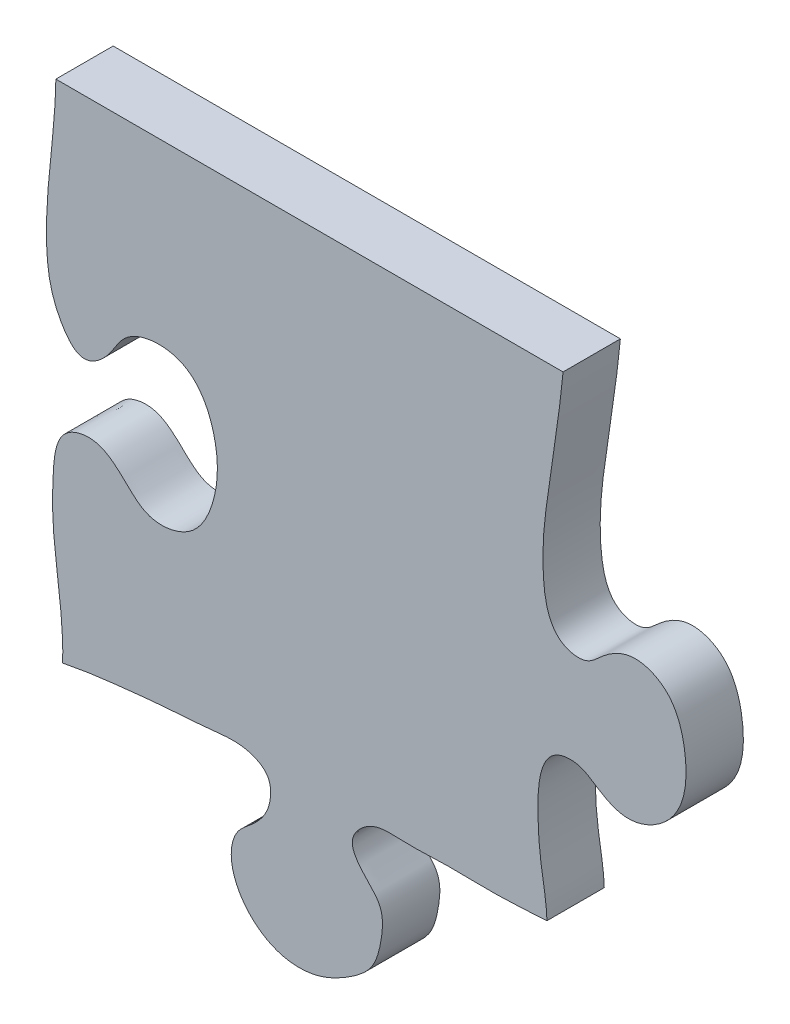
ISO-10303-21;
HEADER;
FILE_DESCRIPTION(('STEP AP214'),'2;1');
FILE_NAME('part.step','',(''),(''),'','','');
FILE_SCHEMA(('AUTOMOTIVE_DESIGN { 1 0 10303 214 1 1 1 1 }'));
ENDSEC;
DATA;
#1=APPLICATION_CONTEXT('core data for automotive mechanical design processes');
#2=APPLICATION_PROTOCOL_DEFINITION('international standard','automotive_design',2000,#1);
#3=PRODUCT_CONTEXT('',#1,'mechanical');
#4=PRODUCT('Part','Part','',(#3));
#5=PRODUCT_RELATED_PRODUCT_CATEGORY('part','',(#4));
#6=PRODUCT_DEFINITION_FORMATION('','',#4);
#7=PRODUCT_DEFINITION_CONTEXT('part definition',#1,'design');
#8=PRODUCT_DEFINITION('design','',#6,#7);
#9=PRODUCT_DEFINITION_SHAPE('','',#8);
#10=(LENGTH_UNIT() NAMED_UNIT(*) SI_UNIT(.MILLI.,.METRE.));
#11=(NAMED_UNIT(*) PLANE_ANGLE_UNIT() SI_UNIT($,.RADIAN.));
#12=(NAMED_UNIT(*) SI_UNIT($,.STERADIAN.) SOLID_ANGLE_UNIT());
#13=UNCERTAINTY_MEASURE_WITH_UNIT(LENGTH_MEASURE(1.E-05),#10,'distance_accuracy_value','');
#14=(GEOMETRIC_REPRESENTATION_CONTEXT(3) GLOBAL_UNCERTAINTY_ASSIGNED_CONTEXT((#13)) GLOBAL_UNIT_ASSIGNED_CONTEXT((#10,
#11,#12)) REPRESENTATION_CONTEXT('',''));
#15=CARTESIAN_POINT('',(0.,0.,0.));
#16=DIRECTION('',(0.,0.,1.));
#17=DIRECTION('',(1.,0.,0.));
#18=AXIS2_PLACEMENT_3D('',#15,#16,#17);
#19=CARTESIAN_POINT('',(-9.39078729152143,356.,-0.00999999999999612));
#20=CARTESIAN_POINT('',(-10.6420004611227,342.109118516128,-0.00999999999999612));
#21=CARTESIAN_POINT('',(-14.6613121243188,319.56927935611,-0.00999999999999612));
#22=CARTESIAN_POINT('',(-17.4473947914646,293.08555207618,-0.00999999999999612));
#23=CARTESIAN_POINT('',(-13.8884373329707,273.667988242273,-0.00999999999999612));
#24=CARTESIAN_POINT('',(-1.07625820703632,271.397705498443,-0.00999999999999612));
#25=CARTESIAN_POINT('',(5.29309239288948,278.450722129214,-0.00999999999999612));
#26=CARTESIAN_POINT('',(14.9258759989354,283.741247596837,-0.00999999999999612));
#27=CARTESIAN_POINT('',(28.790892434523,278.335723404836,-0.00999999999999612));
#28=CARTESIAN_POINT('',(34.7382562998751,261.206713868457,-0.00999999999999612));
#29=CARTESIAN_POINT('',(33.1132905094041,240.122633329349,-0.00999999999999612));
#30=CARTESIAN_POINT('',(14.6676977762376,229.968331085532,-0.00999999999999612));
#31=CARTESIAN_POINT('',(3.42611827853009,235.442407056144,-0.00999999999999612));
#32=CARTESIAN_POINT('',(-2.96249564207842,240.393740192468,-0.00999999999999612));
#33=CARTESIAN_POINT('',(-18.0780076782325,240.138784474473,-0.00999999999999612));
#34=CARTESIAN_POINT('',(-18.5399667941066,222.992463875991,-0.00999999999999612));
#35=CARTESIAN_POINT('',(-17.4385931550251,202.827665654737,-0.00999999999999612));
#36=CARTESIAN_POINT('',(-14.0858554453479,190.221137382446,-0.00999999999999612));
#37=CARTESIAN_POINT('',(-15.5193743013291,175.136568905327,-0.00999999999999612));
#38=CARTESIAN_POINT('',(-16.6888175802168,157.648124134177,-0.00999999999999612));
#39=CARTESIAN_POINT('',(-17.7707660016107,144.240131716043,-0.00999999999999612));
#40=CARTESIAN_POINT('',(-17.3940925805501,124.109890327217,-0.00999999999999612));
#41=CARTESIAN_POINT('',(-18.6861496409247,110.985540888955,-0.00999999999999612));
#42=CARTESIAN_POINT('',(-3.94695866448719,101.126063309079,-0.00999999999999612));
#43=CARTESIAN_POINT('',(4.50824278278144,111.148466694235,-0.00999999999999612));
#44=CARTESIAN_POINT('',(13.1578407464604,120.870763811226,-0.00999999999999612));
#45=CARTESIAN_POINT('',(29.968112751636,122.314288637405,-0.00999999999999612));
#46=CARTESIAN_POINT('',(40.7223803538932,110.783826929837,-0.00999999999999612));
#47=CARTESIAN_POINT('',(45.7909417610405,94.3968136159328,-0.00999999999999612));
#48=CARTESIAN_POINT('',(43.9390810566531,75.8787758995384,-0.00999999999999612));
#49=CARTESIAN_POINT('',(30.503103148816,62.5847389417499,-0.00999999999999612));
#50=CARTESIAN_POINT('',(14.6986660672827,64.8647821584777,-0.00999999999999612));
#51=CARTESIAN_POINT('',(6.48631275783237,74.2887035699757,-0.00999999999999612));
#52=CARTESIAN_POINT('',(-2.74495882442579,80.3019272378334,-0.00999999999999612));
#53=CARTESIAN_POINT('',(-19.8840521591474,73.8019115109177,-0.00999999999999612));
#54=CARTESIAN_POINT('',(-15.1166354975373,44.269693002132,-0.00999999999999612));
#55=CARTESIAN_POINT('',(-13.5094217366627,17.7920418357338,-0.00999999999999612));
#56=CARTESIAN_POINT('',(-10.2430798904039,-1.06342782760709,-0.00999999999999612));
#57=CARTESIAN_POINT('',(-6.15123504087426,-23.5391381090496,-0.00999999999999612));
#58=CARTESIAN_POINT('',(-4.12992604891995,-48.8436757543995,-0.00999999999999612));
#59=CARTESIAN_POINT('',(-23.2142462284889,-47.7574601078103,-0.00999999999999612));
#60=CARTESIAN_POINT('',(-30.0018234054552,-40.5423137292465,-0.00999999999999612));
#61=CARTESIAN_POINT('',(-42.7528213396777,-39.1853410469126,-0.00999999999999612));
#62=CARTESIAN_POINT('',(-57.5092962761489,-47.8418744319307,-0.00999999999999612));
#63=CARTESIAN_POINT('',(-60.2210733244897,-67.5138769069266,-0.00999999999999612));
#64=CARTESIAN_POINT('',(-54.0018378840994,-88.1567638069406,-0.00999999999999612));
#65=CARTESIAN_POINT('',(-33.5101255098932,-90.2818581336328,-0.00999999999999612));
#66=CARTESIAN_POINT('',(-26.938266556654,-78.8436195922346,-0.00999999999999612));
#67=CARTESIAN_POINT('',(-16.0575989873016,-79.9605650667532,-0.00999999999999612));
#68=CARTESIAN_POINT('',(-9.29054500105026,-89.9843542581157,-0.00999999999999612));
#69=CARTESIAN_POINT('',(-9.26037942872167,-106.547726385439,-0.00999999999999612));
#70=CARTESIAN_POINT('',(-10.8655976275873,-129.908253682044,-0.00999999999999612));
#71=CARTESIAN_POINT('',(-18.080355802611,-155.05589418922,-0.00999999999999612));
#72=CARTESIAN_POINT('',(-15.5015350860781,-180.564325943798,-0.00999999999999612));
#73=CARTESIAN_POINT('',(-13.4534563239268,-202.72625863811,-0.00999999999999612));
#74=CARTESIAN_POINT('',(-13.0721771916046,-222.761537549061,-0.00999999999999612));
#75=CARTESIAN_POINT('',(-18.0801009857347,-237.162246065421,-0.00999999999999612));
#76=CARTESIAN_POINT('',(-28.3640065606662,-243.264641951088,-0.00999999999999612));
#77=CARTESIAN_POINT('',(-35.3195309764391,-234.565632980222,-0.00999999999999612));
#78=CARTESIAN_POINT('',(-45.5220607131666,-230.442721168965,-0.00999999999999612));
#79=CARTESIAN_POINT('',(-58.2826152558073,-236.227844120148,-0.00999999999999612));
#80=CARTESIAN_POINT('',(-63.2505187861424,-252.690663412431,-0.00999999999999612));
#81=CARTESIAN_POINT('',(-62.4331763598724,-269.758175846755,-0.00999999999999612));
#82=CARTESIAN_POINT('',(-51.5712190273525,-281.475483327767,-0.00999999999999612));
#83=CARTESIAN_POINT('',(-36.6120763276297,-283.519302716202,-0.00999999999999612));
#84=CARTESIAN_POINT('',(-27.825780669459,-270.933950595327,-0.00999999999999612));
#85=CARTESIAN_POINT('',(-10.9923291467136,-277.705324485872,-0.00999999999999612));
#86=CARTESIAN_POINT('',(-14.9884890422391,-312.557066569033,-0.00999999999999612));
#87=CARTESIAN_POINT('',(-14.8626828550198,-333.640060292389,-0.00999999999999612));
#88=CARTESIAN_POINT('',(-17.0261941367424,-356.,-0.00999999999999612));
#89=B_SPLINE_CURVE_WITH_KNOTS('',3,(#19,#20,#21,#22,#23,#24,#25,#26,#27,#28,#29,#30,#31,#32,#33,
#34,#35,#36,#37,#38,#39,#40,#41,#42,#43,#44,#45,#46,#47,#48,#49,#50,#51,#52,#53,#54,#55,#56,#57,
#58,#59,#60,#61,#62,#63,#64,#65,#66,#67,#68,#69,#70,#71,#72,#73,#74,#75,#76,#77,#78,#79,#80,#81,
#82,#83,#84,#85,#86,#87,#88),.UNSPECIFIED.,.F.,.F.,(4,1,1,1,1,1,1,1,1,1,1,1,1,1,1,1,1,1,1,1,1,1,
1,1,1,1,1,1,1,1,1,1,1,1,1,1,1,1,1,1,1,1,1,1,1,1,1,1,1,1,1,1,1,1,1,1,1,1,1,1,1,1,1,1,1,1,1,4),
(0.,0.0382435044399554,0.06014267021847,0.0759154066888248,0.0830880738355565,
0.0898528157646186,0.100420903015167,0.110971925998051,0.125303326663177,0.146622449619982,
0.16313068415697,0.171984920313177,0.178976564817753,0.184846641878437,0.208558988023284,
0.213294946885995,0.232206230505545,0.247690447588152,0.25282597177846,0.280146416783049,
0.285652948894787,0.304476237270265,0.313783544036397,0.32377706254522,0.334253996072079,
0.350240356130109,0.361652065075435,0.37428972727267,0.396319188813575,0.408299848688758,
0.421251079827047,0.43387737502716,0.442611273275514,0.448402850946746,0.478919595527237,
0.50340807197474,0.525599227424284,0.531488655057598,0.562302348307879,0.569309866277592,
0.576593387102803,0.588291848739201,0.600948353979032,0.618957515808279,0.638096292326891,
0.652011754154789,0.663601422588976,0.667955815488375,0.679319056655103,0.692000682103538,
0.712742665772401,0.742765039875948,0.761777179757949,0.781638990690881,0.803327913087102,
0.815753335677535,0.82139602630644,0.831491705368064,0.840302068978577,0.85029925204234,
0.865053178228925,0.884091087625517,0.893653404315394,0.906570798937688,0.918850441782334,
0.928550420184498,0.945628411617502,1.),.UNSPECIFIED.);
#90=DIRECTION('',(0.,0.,1.));
#91=VECTOR('',#90,1.);
#92=SURFACE_OF_LINEAR_EXTRUSION('',#89,#91);
#93=DIRECTION('',(0.,0.,1.));
#94=VECTOR('',#93,1.);
#95=CARTESIAN_POINT('',(-15.0113557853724,187.327774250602,-0.00999999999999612));
#96=LINE('',#95,#94);
#97=CARTESIAN_POINT('',(-15.0113557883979,187.32777425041,20.));
#98=VERTEX_POINT('',#97);
#99=CARTESIAN_POINT('',(-15.0113557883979,187.32777425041,0.));
#100=VERTEX_POINT('',#99);
#101=EDGE_CURVE('E82',#98,#100,#96,.F.);
#102=ORIENTED_EDGE('',*,*,#101,.T.);
#103=CARTESIAN_POINT('',(-9.39078729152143,356.,0.));
#104=CARTESIAN_POINT('',(-10.6420004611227,342.109118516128,0.));
#105=CARTESIAN_POINT('',(-14.6613121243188,319.56927935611,0.));
#106=CARTESIAN_POINT('',(-17.4473947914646,293.08555207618,0.));
#107=CARTESIAN_POINT('',(-13.8884373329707,273.667988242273,0.));
#108=CARTESIAN_POINT('',(-1.07625820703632,271.397705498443,0.));
#109=CARTESIAN_POINT('',(5.29309239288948,278.450722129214,0.));
#110=CARTESIAN_POINT('',(14.9258759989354,283.741247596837,0.));
#111=CARTESIAN_POINT('',(28.790892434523,278.335723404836,0.));
#112=CARTESIAN_POINT('',(34.7382562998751,261.206713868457,0.));
#113=CARTESIAN_POINT('',(33.1132905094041,240.122633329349,0.));
#114=CARTESIAN_POINT('',(14.6676977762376,229.968331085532,0.));
#115=CARTESIAN_POINT('',(3.42611827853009,235.442407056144,0.));
#116=CARTESIAN_POINT('',(-2.96249564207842,240.393740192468,0.));
#117=CARTESIAN_POINT('',(-18.0780076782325,240.138784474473,0.));
#118=CARTESIAN_POINT('',(-18.5399667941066,222.992463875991,0.));
#119=CARTESIAN_POINT('',(-17.4385931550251,202.827665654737,0.));
#120=CARTESIAN_POINT('',(-14.0858554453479,190.221137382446,0.));
#121=CARTESIAN_POINT('',(-15.5193743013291,175.136568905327,0.));
#122=CARTESIAN_POINT('',(-16.6888175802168,157.648124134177,0.));
#123=CARTESIAN_POINT('',(-17.7707660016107,144.240131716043,0.));
#124=CARTESIAN_POINT('',(-17.3940925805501,124.109890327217,0.));
#125=CARTESIAN_POINT('',(-18.6861496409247,110.985540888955,0.));
#126=CARTESIAN_POINT('',(-3.94695866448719,101.126063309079,0.));
#127=CARTESIAN_POINT('',(4.50824278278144,111.148466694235,0.));
#128=CARTESIAN_POINT('',(13.1578407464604,120.870763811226,0.));
#129=CARTESIAN_POINT('',(29.968112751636,122.314288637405,0.));
#130=CARTESIAN_POINT('',(40.7223803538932,110.783826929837,0.));
#131=CARTESIAN_POINT('',(45.7909417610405,94.3968136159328,0.));
#132=CARTESIAN_POINT('',(43.9390810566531,75.8787758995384,0.));
#133=CARTESIAN_POINT('',(30.503103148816,62.5847389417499,0.));
#134=CARTESIAN_POINT('',(14.6986660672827,64.8647821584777,0.));
#135=CARTESIAN_POINT('',(6.48631275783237,74.2887035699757,0.));
#136=CARTESIAN_POINT('',(-2.74495882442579,80.3019272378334,0.));
#137=CARTESIAN_POINT('',(-19.8840521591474,73.8019115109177,0.));
#138=CARTESIAN_POINT('',(-15.1166354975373,44.269693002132,0.));
#139=CARTESIAN_POINT('',(-13.5094217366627,17.7920418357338,0.));
#140=CARTESIAN_POINT('',(-10.2430798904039,-1.06342782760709,0.));
#141=CARTESIAN_POINT('',(-6.15123504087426,-23.5391381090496,0.));
#142=CARTESIAN_POINT('',(-4.12992604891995,-48.8436757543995,0.));
#143=CARTESIAN_POINT('',(-23.2142462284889,-47.7574601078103,0.));
#144=CARTESIAN_POINT('',(-30.0018234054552,-40.5423137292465,0.));
#145=CARTESIAN_POINT('',(-42.7528213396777,-39.1853410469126,0.));
#146=CARTESIAN_POINT('',(-57.5092962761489,-47.8418744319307,0.));
#147=CARTESIAN_POINT('',(-60.2210733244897,-67.5138769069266,0.));
#148=CARTESIAN_POINT('',(-54.0018378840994,-88.1567638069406,0.));
#149=CARTESIAN_POINT('',(-33.5101255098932,-90.2818581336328,0.));
#150=CARTESIAN_POINT('',(-26.938266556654,-78.8436195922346,0.));
#151=CARTESIAN_POINT('',(-16.0575989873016,-79.9605650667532,0.));
#152=CARTESIAN_POINT('',(-9.29054500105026,-89.9843542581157,0.));
#153=CARTESIAN_POINT('',(-9.26037942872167,-106.547726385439,0.));
#154=CARTESIAN_POINT('',(-10.8655976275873,-129.908253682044,0.));
#155=CARTESIAN_POINT('',(-18.080355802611,-155.05589418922,0.));
#156=CARTESIAN_POINT('',(-15.5015350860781,-180.564325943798,0.));
#157=CARTESIAN_POINT('',(-13.4534563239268,-202.72625863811,0.));
#158=CARTESIAN_POINT('',(-13.0721771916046,-222.761537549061,0.));
#159=CARTESIAN_POINT('',(-18.0801009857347,-237.162246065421,0.));
#160=CARTESIAN_POINT('',(-28.3640065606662,-243.264641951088,0.));
#161=CARTESIAN_POINT('',(-35.3195309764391,-234.565632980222,0.));
#162=CARTESIAN_POINT('',(-45.5220607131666,-230.442721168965,0.));
#163=CARTESIAN_POINT('',(-58.2826152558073,-236.227844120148,0.));
#164=CARTESIAN_POINT('',(-63.2505187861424,-252.690663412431,0.));
#165=CARTESIAN_POINT('',(-62.4331763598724,-269.758175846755,0.));
#166=CARTESIAN_POINT('',(-51.5712190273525,-281.475483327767,0.));
#167=CARTESIAN_POINT('',(-36.6120763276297,-283.519302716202,0.));
#168=CARTESIAN_POINT('',(-27.825780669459,-270.933950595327,0.));
#169=CARTESIAN_POINT('',(-10.9923291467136,-277.705324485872,0.));
#170=CARTESIAN_POINT('',(-14.9884890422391,-312.557066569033,0.));
#171=CARTESIAN_POINT('',(-14.8626828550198,-333.640060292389,0.));
#172=CARTESIAN_POINT('',(-17.0261941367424,-356.,0.));
#173=B_SPLINE_CURVE_WITH_KNOTS('',3,(#103,#104,#105,#106,#107,#108,#109,#110,#111,#112,#113,
#114,#115,#116,#117,#118,#119,#120,#121,#122,#123,#124,#125,#126,#127,#128,#129,#130,#131,#132,
#133,#134,#135,#136,#137,#138,#139,#140,#141,#142,#143,#144,#145,#146,#147,#148,#149,#150,#151,
#152,#153,#154,#155,#156,#157,#158,#159,#160,#161,#162,#163,#164,#165,#166,#167,#168,#169,#170,
#171,#172),.UNSPECIFIED.,.F.,.F.,(4,1,1,1,1,1,1,1,1,1,1,1,1,1,1,1,1,1,1,1,1,1,1,1,1,1,1,1,1,1,1,
1,1,1,1,1,1,1,1,1,1,1,1,1,1,1,1,1,1,1,1,1,1,1,1,1,1,1,1,1,1,1,1,1,1,1,1,4),(0.,
0.0382435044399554,0.06014267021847,0.0759154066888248,0.0830880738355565,0.0898528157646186,
0.100420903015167,0.110971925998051,0.125303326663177,0.146622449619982,0.16313068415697,
0.171984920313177,0.178976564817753,0.184846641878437,0.208558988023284,0.213294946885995,
0.232206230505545,0.247690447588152,0.25282597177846,0.280146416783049,0.285652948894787,
0.304476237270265,0.313783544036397,0.32377706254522,0.334253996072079,0.350240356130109,
0.361652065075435,0.37428972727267,0.396319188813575,0.408299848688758,0.421251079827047,
0.43387737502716,0.442611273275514,0.448402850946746,0.478919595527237,0.50340807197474,
0.525599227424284,0.531488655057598,0.562302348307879,0.569309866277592,0.576593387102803,
0.588291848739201,0.600948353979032,0.618957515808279,0.638096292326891,0.652011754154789,
0.663601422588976,0.667955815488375,0.679319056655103,0.692000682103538,0.712742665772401,
0.742765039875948,0.761777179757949,0.781638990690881,0.803327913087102,0.815753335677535,
0.82139602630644,0.831491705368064,0.840302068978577,0.85029925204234,0.865053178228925,
0.884091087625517,0.893653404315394,0.906570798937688,0.918850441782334,0.928550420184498,
0.945628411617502,1.),.UNSPECIFIED.);
#174=CARTESIAN_POINT('',(-9.39078729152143,356.,0.));
#175=VERTEX_POINT('',#174);
#176=EDGE_CURVE('E112',#175,#100,#173,.T.);
#177=ORIENTED_EDGE('',*,*,#176,.F.);
#178=DIRECTION('',(0.,0.,1.));
#179=VECTOR('',#178,1.);
#180=CARTESIAN_POINT('',(-9.39078729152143,356.,-0.00999999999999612));
#181=LINE('',#180,#179);
#182=CARTESIAN_POINT('',(-9.39078729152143,356.,20.));
#183=VERTEX_POINT('',#182);
#184=EDGE_CURVE('E83',#183,#175,#181,.F.);
#185=ORIENTED_EDGE('',*,*,#184,.F.);
#186=CARTESIAN_POINT('',(-9.39078729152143,356.,20.));
#187=CARTESIAN_POINT('',(-10.6420004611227,342.109118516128,20.));
#188=CARTESIAN_POINT('',(-14.6613121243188,319.56927935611,20.));
#189=CARTESIAN_POINT('',(-17.4473947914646,293.08555207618,20.));
#190=CARTESIAN_POINT('',(-13.8884373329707,273.667988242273,20.));
#191=CARTESIAN_POINT('',(-1.07625820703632,271.397705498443,20.));
#192=CARTESIAN_POINT('',(5.29309239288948,278.450722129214,20.));
#193=CARTESIAN_POINT('',(14.9258759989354,283.741247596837,20.));
#194=CARTESIAN_POINT('',(28.790892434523,278.335723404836,20.));
#195=CARTESIAN_POINT('',(34.7382562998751,261.206713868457,20.));
#196=CARTESIAN_POINT('',(33.1132905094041,240.122633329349,20.));
#197=CARTESIAN_POINT('',(14.6676977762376,229.968331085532,20.));
#198=CARTESIAN_POINT('',(3.42611827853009,235.442407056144,20.));
#199=CARTESIAN_POINT('',(-2.96249564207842,240.393740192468,20.));
#200=CARTESIAN_POINT('',(-18.0780076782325,240.138784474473,20.));
#201=CARTESIAN_POINT('',(-18.5399667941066,222.992463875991,20.));
#202=CARTESIAN_POINT('',(-17.4385931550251,202.827665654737,20.));
#203=CARTESIAN_POINT('',(-14.0858554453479,190.221137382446,20.));
#204=CARTESIAN_POINT('',(-15.5193743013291,175.136568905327,20.));
#205=CARTESIAN_POINT('',(-16.6888175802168,157.648124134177,20.));
#206=CARTESIAN_POINT('',(-17.7707660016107,144.240131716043,20.));
#207=CARTESIAN_POINT('',(-17.3940925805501,124.109890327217,20.));
#208=CARTESIAN_POINT('',(-18.6861496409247,110.985540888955,20.));
#209=CARTESIAN_POINT('',(-3.94695866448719,101.126063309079,20.));
#210=CARTESIAN_POINT('',(4.50824278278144,111.148466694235,20.));
#211=CARTESIAN_POINT('',(13.1578407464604,120.870763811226,20.));
#212=CARTESIAN_POINT('',(29.968112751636,122.314288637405,20.));
#213=CARTESIAN_POINT('',(40.7223803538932,110.783826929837,20.));
#214=CARTESIAN_POINT('',(45.7909417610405,94.3968136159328,20.));
#215=CARTESIAN_POINT('',(43.9390810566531,75.8787758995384,20.));
#216=CARTESIAN_POINT('',(30.503103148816,62.5847389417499,20.));
#217=CARTESIAN_POINT('',(14.6986660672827,64.8647821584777,20.));
#218=CARTESIAN_POINT('',(6.48631275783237,74.2887035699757,20.));
#219=CARTESIAN_POINT('',(-2.74495882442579,80.3019272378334,20.));
#220=CARTESIAN_POINT('',(-19.8840521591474,73.8019115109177,20.));
#221=CARTESIAN_POINT('',(-15.1166354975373,44.269693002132,20.));
#222=CARTESIAN_POINT('',(-13.5094217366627,17.7920418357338,20.));
#223=CARTESIAN_POINT('',(-10.2430798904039,-1.06342782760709,20.));
#224=CARTESIAN_POINT('',(-6.15123504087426,-23.5391381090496,20.));
#225=CARTESIAN_POINT('',(-4.12992604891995,-48.8436757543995,20.));
#226=CARTESIAN_POINT('',(-23.2142462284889,-47.7574601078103,20.));
#227=CARTESIAN_POINT('',(-30.0018234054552,-40.5423137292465,20.));
#228=CARTESIAN_POINT('',(-42.7528213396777,-39.1853410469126,20.));
#229=CARTESIAN_POINT('',(-57.5092962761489,-47.8418744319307,20.));
#230=CARTESIAN_POINT('',(-60.2210733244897,-67.5138769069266,20.));
#231=CARTESIAN_POINT('',(-54.0018378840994,-88.1567638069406,20.));
#232=CARTESIAN_POINT('',(-33.5101255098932,-90.2818581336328,20.));
#233=CARTESIAN_POINT('',(-26.938266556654,-78.8436195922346,20.));
#234=CARTESIAN_POINT('',(-16.0575989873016,-79.9605650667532,20.));
#235=CARTESIAN_POINT('',(-9.29054500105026,-89.9843542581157,20.));
#236=CARTESIAN_POINT('',(-9.26037942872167,-106.547726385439,20.));
#237=CARTESIAN_POINT('',(-10.8655976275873,-129.908253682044,20.));
#238=CARTESIAN_POINT('',(-18.080355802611,-155.05589418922,20.));
#239=CARTESIAN_POINT('',(-15.5015350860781,-180.564325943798,20.));
#240=CARTESIAN_POINT('',(-13.4534563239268,-202.72625863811,20.));
#241=CARTESIAN_POINT('',(-13.0721771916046,-222.761537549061,20.));
#242=CARTESIAN_POINT('',(-18.0801009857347,-237.162246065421,20.));
#243=CARTESIAN_POINT('',(-28.3640065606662,-243.264641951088,20.));
#244=CARTESIAN_POINT('',(-35.3195309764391,-234.565632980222,20.));
#245=CARTESIAN_POINT('',(-45.5220607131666,-230.442721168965,20.));
#246=CARTESIAN_POINT('',(-58.2826152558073,-236.227844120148,20.));
#247=CARTESIAN_POINT('',(-63.2505187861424,-252.690663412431,20.));
#248=CARTESIAN_POINT('',(-62.4331763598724,-269.758175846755,20.));
#249=CARTESIAN_POINT('',(-51.5712190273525,-281.475483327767,20.));
#250=CARTESIAN_POINT('',(-36.6120763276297,-283.519302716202,20.));
#251=CARTESIAN_POINT('',(-27.825780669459,-270.933950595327,20.));
#252=CARTESIAN_POINT('',(-10.9923291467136,-277.705324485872,20.));
#253=CARTESIAN_POINT('',(-14.9884890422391,-312.557066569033,20.));
#254=CARTESIAN_POINT('',(-14.8626828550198,-333.640060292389,20.));
#255=CARTESIAN_POINT('',(-17.0261941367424,-356.,20.));
#256=B_SPLINE_CURVE_WITH_KNOTS('',3,(#186,#187,#188,#189,#190,#191,#192,#193,#194,#195,#196,
#197,#198,#199,#200,#201,#202,#203,#204,#205,#206,#207,#208,#209,#210,#211,#212,#213,#214,#215,
#216,#217,#218,#219,#220,#221,#222,#223,#224,#225,#226,#227,#228,#229,#230,#231,#232,#233,#234,
#235,#236,#237,#238,#239,#240,#241,#242,#243,#244,#245,#246,#247,#248,#249,#250,#251,#252,#253,
#254,#255),.UNSPECIFIED.,.F.,.F.,(4,1,1,1,1,1,1,1,1,1,1,1,1,1,1,1,1,1,1,1,1,1,1,1,1,1,1,1,1,1,1,
1,1,1,1,1,1,1,1,1,1,1,1,1,1,1,1,1,1,1,1,1,1,1,1,1,1,1,1,1,1,1,1,1,1,1,1,4),(0.,
0.0382435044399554,0.06014267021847,0.0759154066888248,0.0830880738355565,0.0898528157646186,
0.100420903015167,0.110971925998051,0.125303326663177,0.146622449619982,0.16313068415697,
0.171984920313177,0.178976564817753,0.184846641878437,0.208558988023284,0.213294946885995,
0.232206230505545,0.247690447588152,0.25282597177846,0.280146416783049,0.285652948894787,
0.304476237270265,0.313783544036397,0.32377706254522,0.334253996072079,0.350240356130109,
0.361652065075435,0.37428972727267,0.396319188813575,0.408299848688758,0.421251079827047,
0.43387737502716,0.442611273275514,0.448402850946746,0.478919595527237,0.50340807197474,
0.525599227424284,0.531488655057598,0.562302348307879,0.569309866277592,0.576593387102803,
0.588291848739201,0.600948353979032,0.618957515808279,0.638096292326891,0.652011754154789,
0.663601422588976,0.667955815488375,0.679319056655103,0.692000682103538,0.712742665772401,
0.742765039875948,0.761777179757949,0.781638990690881,0.803327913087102,0.815753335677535,
0.82139602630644,0.831491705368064,0.840302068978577,0.85029925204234,0.865053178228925,
0.884091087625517,0.893653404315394,0.906570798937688,0.918850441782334,0.928550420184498,
0.945628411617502,1.),.UNSPECIFIED.);
#257=EDGE_CURVE('E79',#183,#98,#256,.T.);
#258=ORIENTED_EDGE('',*,*,#257,.T.);
#259=EDGE_LOOP('',(#102,#177,#185,#258));
#260=FACE_BOUND('',#259,.T.);
#261=ADVANCED_FACE('F34',(#260),#92,.F.);
#262=CARTESIAN_POINT('',(-186.393246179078,356.,-0.00999999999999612));
#263=CARTESIAN_POINT('',(-186.465644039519,346.788250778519,-0.00999999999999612));
#264=CARTESIAN_POINT('',(-188.628884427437,329.478394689,-0.00999999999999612));
#265=CARTESIAN_POINT('',(-190.429976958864,304.816732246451,-0.00999999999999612));
#266=CARTESIAN_POINT('',(-187.884620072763,287.022607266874,-0.00999999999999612));
#267=CARTESIAN_POINT('',(-177.83183487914,273.701157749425,-0.00999999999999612));
#268=CARTESIAN_POINT('',(-167.372440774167,281.069990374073,-0.00999999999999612));
#269=CARTESIAN_POINT('',(-162.424812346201,293.671302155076,-0.00999999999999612));
#270=CARTESIAN_POINT('',(-138.980403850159,295.954762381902,-0.00999999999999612));
#271=CARTESIAN_POINT('',(-129.023505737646,274.502332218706,-0.00999999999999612));
#272=CARTESIAN_POINT('',(-130.151753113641,256.130310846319,-0.00999999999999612));
#273=CARTESIAN_POINT('',(-138.180313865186,240.882815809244,-0.00999999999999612));
#274=CARTESIAN_POINT('',(-153.903325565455,237.974697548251,-0.00999999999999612));
#275=CARTESIAN_POINT('',(-162.781582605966,247.270783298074,-0.00999999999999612));
#276=CARTESIAN_POINT('',(-171.61954140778,254.983724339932,-0.00999999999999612));
#277=CARTESIAN_POINT('',(-186.267660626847,251.663377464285,-0.00999999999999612));
#278=CARTESIAN_POINT('',(-188.178219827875,226.271427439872,-0.00999999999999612));
#279=CARTESIAN_POINT('',(-186.828985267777,214.10322906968,-0.00999999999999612));
#280=CARTESIAN_POINT('',(-182.631402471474,181.666904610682,-0.00999999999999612));
#281=CARTESIAN_POINT('',(-187.119801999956,157.75465666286,-0.00999999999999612));
#282=CARTESIAN_POINT('',(-187.457937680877,142.904539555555,-0.00999999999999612));
#283=CARTESIAN_POINT('',(-184.089404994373,126.204275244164,-0.00999999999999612));
#284=CARTESIAN_POINT('',(-168.499206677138,126.488047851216,-0.00999999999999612));
#285=CARTESIAN_POINT('',(-158.423592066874,136.759079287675,-0.00999999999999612));
#286=CARTESIAN_POINT('',(-133.598254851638,130.460350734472,-0.00999999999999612));
#287=CARTESIAN_POINT('',(-132.174041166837,109.25711139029,-0.00999999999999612));
#288=CARTESIAN_POINT('',(-137.401430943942,84.0677449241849,-0.00999999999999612));
#289=CARTESIAN_POINT('',(-159.905312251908,82.8448138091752,-0.00999999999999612));
#290=CARTESIAN_POINT('',(-167.594499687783,95.2630828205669,-0.00999999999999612));
#291=CARTESIAN_POINT('',(-184.064608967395,90.371493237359,-0.00999999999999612));
#292=CARTESIAN_POINT('',(-186.999172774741,63.1173196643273,-0.00999999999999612));
#293=CARTESIAN_POINT('',(-188.17555036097,34.3474510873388,-0.00999999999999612));
#294=CARTESIAN_POINT('',(-189.520016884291,-1.94344937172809,-0.00999999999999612));
#295=CARTESIAN_POINT('',(-192.230906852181,-38.9111914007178,-0.00999999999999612));
#296=CARTESIAN_POINT('',(-193.196462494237,-56.4819013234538,-0.00999999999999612));
#297=CARTESIAN_POINT('',(-187.787083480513,-81.0819408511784,-0.00999999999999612));
#298=CARTESIAN_POINT('',(-174.027975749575,-78.613025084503,-0.00999999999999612));
#299=CARTESIAN_POINT('',(-167.64120428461,-66.7586676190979,-0.00999999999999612));
#300=CARTESIAN_POINT('',(-138.878579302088,-69.8200733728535,-0.00999999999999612));
#301=CARTESIAN_POINT('',(-138.315063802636,-94.39593724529,-0.00999999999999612));
#302=CARTESIAN_POINT('',(-145.951566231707,-114.49908529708,-0.00999999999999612));
#303=CARTESIAN_POINT('',(-163.555921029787,-121.175747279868,-0.00999999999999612));
#304=CARTESIAN_POINT('',(-172.11578880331,-114.919909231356,-0.00999999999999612));
#305=CARTESIAN_POINT('',(-176.485425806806,-107.364168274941,-0.00999999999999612));
#306=CARTESIAN_POINT('',(-184.309097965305,-107.607264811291,-0.00999999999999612));
#307=CARTESIAN_POINT('',(-188.561946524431,-116.100575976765,-0.00999999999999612));
#308=CARTESIAN_POINT('',(-189.834439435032,-132.751458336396,-0.00999999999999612));
#309=CARTESIAN_POINT('',(-188.899668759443,-143.69775261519,-0.00999999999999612));
#310=CARTESIAN_POINT('',(-186.87437190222,-176.639875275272,-0.00999999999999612));
#311=CARTESIAN_POINT('',(-187.115886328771,-188.95785352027,-0.00999999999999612));
#312=CARTESIAN_POINT('',(-184.068917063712,-208.490912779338,-0.00999999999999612));
#313=CARTESIAN_POINT('',(-184.462371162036,-228.434350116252,-0.00999999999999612));
#314=CARTESIAN_POINT('',(-182.717405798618,-241.744671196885,-0.00999999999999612));
#315=CARTESIAN_POINT('',(-190.107123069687,-258.646375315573,-0.00999999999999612));
#316=CARTESIAN_POINT('',(-204.50360377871,-253.849993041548,-0.00999999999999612));
#317=CARTESIAN_POINT('',(-211.768269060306,-241.698033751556,-0.00999999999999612));
#318=CARTESIAN_POINT('',(-230.141572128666,-243.165284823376,-0.00999999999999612));
#319=CARTESIAN_POINT('',(-238.864067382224,-259.702852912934,-0.00999999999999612));
#320=CARTESIAN_POINT('',(-237.82033634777,-276.944530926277,-0.00999999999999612));
#321=CARTESIAN_POINT('',(-229.688332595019,-293.402921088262,-0.00999999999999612));
#322=CARTESIAN_POINT('',(-210.804716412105,-298.51720908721,-0.00999999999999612));
#323=CARTESIAN_POINT('',(-204.725260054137,-287.600226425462,-0.00999999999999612));
#324=CARTESIAN_POINT('',(-198.130842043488,-278.388409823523,-0.00999999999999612));
#325=CARTESIAN_POINT('',(-189.724281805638,-288.428094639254,-0.00999999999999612));
#326=CARTESIAN_POINT('',(-185.110914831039,-304.121783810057,-0.00999999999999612));
#327=CARTESIAN_POINT('',(-188.504639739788,-328.326605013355,-0.00999999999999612));
#328=CARTESIAN_POINT('',(-188.031330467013,-347.655914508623,-0.00999999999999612));
#329=CARTESIAN_POINT('',(-188.197680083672,-356.,-0.00999999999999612));
#330=B_SPLINE_CURVE_WITH_KNOTS('',3,(#262,#263,#264,#265,#266,#267,#268,#269,#270,#271,#272,
#273,#274,#275,#276,#277,#278,#279,#280,#281,#282,#283,#284,#285,#286,#287,#288,#289,#290,#291,
#292,#293,#294,#295,#296,#297,#298,#299,#300,#301,#302,#303,#304,#305,#306,#307,#308,#309,#310,
#311,#312,#313,#314,#315,#316,#317,#318,#319,#320,#321,#322,#323,#324,#325,#326,#327,#328,#329),
.UNSPECIFIED.,.F.,.F.,(4,1,1,1,1,1,1,1,1,1,1,1,1,1,1,1,1,1,1,1,1,1,1,1,1,1,1,1,1,1,1,1,1,1,1,1,
1,1,1,1,1,1,1,1,1,1,1,1,1,1,1,1,1,1,1,1,1,1,1,1,1,1,1,1,1,4),(0.,0.0262331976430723,
0.050560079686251,0.0695219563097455,0.0800713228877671,0.0885051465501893,0.099482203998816,
0.118619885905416,0.138837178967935,0.157899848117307,0.171291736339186,0.185151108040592,
0.19559453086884,0.206745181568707,0.217337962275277,0.230877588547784,0.26409725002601,
0.28835141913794,0.305292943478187,0.32505690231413,0.334743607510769,0.348191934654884,
0.358741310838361,0.375812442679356,0.401272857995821,0.416827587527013,0.432882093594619,
0.444490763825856,0.458014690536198,0.481063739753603,0.510647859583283,0.548186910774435,
0.587648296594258,0.610908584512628,0.621783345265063,0.631931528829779,0.643591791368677,
0.658807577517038,0.686126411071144,0.703957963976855,0.718649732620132,0.731300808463,
0.735266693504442,0.736591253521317,0.743662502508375,0.746501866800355,0.76410099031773,
0.785041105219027,0.790214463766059,0.812987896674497,0.817887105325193,0.836359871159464,
0.84408330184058,0.853053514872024,0.86313504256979,0.875355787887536,0.885829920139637,
0.902341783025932,0.912788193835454,0.926625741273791,0.934943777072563,0.940543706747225,
0.946912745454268,0.957064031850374,0.980148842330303,1.),.UNSPECIFIED.);
#331=DIRECTION('',(0.,0.,1.));
#332=VECTOR('',#331,1.);
#333=SURFACE_OF_LINEAR_EXTRUSION('',#330,#332);
#334=DIRECTION('',(0.,0.,1.));
#335=VECTOR('',#334,1.);
#336=CARTESIAN_POINT('',(-184.013210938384,180.695478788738,-0.00999999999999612));
#337=LINE('',#336,#335);
#338=CARTESIAN_POINT('',(-184.013210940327,180.695478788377,20.));
#339=VERTEX_POINT('',#338);
#340=CARTESIAN_POINT('',(-184.013210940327,180.695478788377,0.));
#341=VERTEX_POINT('',#340);
#342=EDGE_CURVE('E90',#339,#341,#337,.F.);
#343=ORIENTED_EDGE('',*,*,#342,.F.);
#344=CARTESIAN_POINT('',(-186.393246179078,356.,20.));
#345=CARTESIAN_POINT('',(-186.465644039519,346.788250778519,20.));
#346=CARTESIAN_POINT('',(-188.628884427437,329.478394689,20.));
#347=CARTESIAN_POINT('',(-190.429976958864,304.816732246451,20.));
#348=CARTESIAN_POINT('',(-187.884620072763,287.022607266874,20.));
#349=CARTESIAN_POINT('',(-177.83183487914,273.701157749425,20.));
#350=CARTESIAN_POINT('',(-167.372440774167,281.069990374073,20.));
#351=CARTESIAN_POINT('',(-162.424812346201,293.671302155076,20.));
#352=CARTESIAN_POINT('',(-138.980403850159,295.954762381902,20.));
#353=CARTESIAN_POINT('',(-129.023505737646,274.502332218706,20.));
#354=CARTESIAN_POINT('',(-130.151753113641,256.130310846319,20.));
#355=CARTESIAN_POINT('',(-138.180313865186,240.882815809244,20.));
#356=CARTESIAN_POINT('',(-153.903325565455,237.974697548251,20.));
#357=CARTESIAN_POINT('',(-162.781582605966,247.270783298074,20.));
#358=CARTESIAN_POINT('',(-171.61954140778,254.983724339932,20.));
#359=CARTESIAN_POINT('',(-186.267660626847,251.663377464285,20.));
#360=CARTESIAN_POINT('',(-188.178219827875,226.271427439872,20.));
#361=CARTESIAN_POINT('',(-186.828985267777,214.10322906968,20.));
#362=CARTESIAN_POINT('',(-182.631402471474,181.666904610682,20.));
#363=CARTESIAN_POINT('',(-187.119801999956,157.75465666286,20.));
#364=CARTESIAN_POINT('',(-187.457937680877,142.904539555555,20.));
#365=CARTESIAN_POINT('',(-184.089404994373,126.204275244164,20.));
#366=CARTESIAN_POINT('',(-168.499206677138,126.488047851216,20.));
#367=CARTESIAN_POINT('',(-158.423592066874,136.759079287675,20.));
#368=CARTESIAN_POINT('',(-133.598254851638,130.460350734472,20.));
#369=CARTESIAN_POINT('',(-132.174041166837,109.25711139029,20.));
#370=CARTESIAN_POINT('',(-137.401430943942,84.0677449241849,20.));
#371=CARTESIAN_POINT('',(-159.905312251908,82.8448138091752,20.));
#372=CARTESIAN_POINT('',(-167.594499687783,95.2630828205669,20.));
#373=CARTESIAN_POINT('',(-184.064608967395,90.371493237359,20.));
#374=CARTESIAN_POINT('',(-186.999172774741,63.1173196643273,20.));
#375=CARTESIAN_POINT('',(-188.17555036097,34.3474510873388,20.));
#376=CARTESIAN_POINT('',(-189.520016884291,-1.94344937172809,20.));
#377=CARTESIAN_POINT('',(-192.230906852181,-38.9111914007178,20.));
#378=CARTESIAN_POINT('',(-193.196462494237,-56.4819013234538,20.));
#379=CARTESIAN_POINT('',(-187.787083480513,-81.0819408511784,20.));
#380=CARTESIAN_POINT('',(-174.027975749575,-78.613025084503,20.));
#381=CARTESIAN_POINT('',(-167.64120428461,-66.7586676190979,20.));
#382=CARTESIAN_POINT('',(-138.878579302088,-69.8200733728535,20.));
#383=CARTESIAN_POINT('',(-138.315063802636,-94.39593724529,20.));
#384=CARTESIAN_POINT('',(-145.951566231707,-114.49908529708,20.));
#385=CARTESIAN_POINT('',(-163.555921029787,-121.175747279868,20.));
#386=CARTESIAN_POINT('',(-172.11578880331,-114.919909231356,20.));
#387=CARTESIAN_POINT('',(-176.485425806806,-107.364168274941,20.));
#388=CARTESIAN_POINT('',(-184.309097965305,-107.607264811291,20.));
#389=CARTESIAN_POINT('',(-188.561946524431,-116.100575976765,20.));
#390=CARTESIAN_POINT('',(-189.834439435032,-132.751458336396,20.));
#391=CARTESIAN_POINT('',(-188.899668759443,-143.69775261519,20.));
#392=CARTESIAN_POINT('',(-186.87437190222,-176.639875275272,20.));
#393=CARTESIAN_POINT('',(-187.115886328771,-188.95785352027,20.));
#394=CARTESIAN_POINT('',(-184.068917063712,-208.490912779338,20.));
#395=CARTESIAN_POINT('',(-184.462371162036,-228.434350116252,20.));
#396=CARTESIAN_POINT('',(-182.717405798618,-241.744671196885,20.));
#397=CARTESIAN_POINT('',(-190.107123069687,-258.646375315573,20.));
#398=CARTESIAN_POINT('',(-204.50360377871,-253.849993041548,20.));
#399=CARTESIAN_POINT('',(-211.768269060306,-241.698033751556,20.));
#400=CARTESIAN_POINT('',(-230.141572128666,-243.165284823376,20.));
#401=CARTESIAN_POINT('',(-238.864067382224,-259.702852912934,20.));
#402=CARTESIAN_POINT('',(-237.82033634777,-276.944530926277,20.));
#403=CARTESIAN_POINT('',(-229.688332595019,-293.402921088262,20.));
#404=CARTESIAN_POINT('',(-210.804716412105,-298.51720908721,20.));
#405=CARTESIAN_POINT('',(-204.725260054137,-287.600226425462,20.));
#406=CARTESIAN_POINT('',(-198.130842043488,-278.388409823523,20.));
#407=CARTESIAN_POINT('',(-189.724281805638,-288.428094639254,20.));
#408=CARTESIAN_POINT('',(-185.110914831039,-304.121783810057,20.));
#409=CARTESIAN_POINT('',(-188.504639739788,-328.326605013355,20.));
#410=CARTESIAN_POINT('',(-188.031330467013,-347.655914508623,20.));
#411=CARTESIAN_POINT('',(-188.197680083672,-356.,20.));
#412=B_SPLINE_CURVE_WITH_KNOTS('',3,(#344,#345,#346,#347,#348,#349,#350,#351,#352,#353,#354,
#355,#356,#357,#358,#359,#360,#361,#362,#363,#364,#365,#366,#367,#368,#369,#370,#371,#372,#373,
#374,#375,#376,#377,#378,#379,#380,#381,#382,#383,#384,#385,#386,#387,#388,#389,#390,#391,#392,
#393,#394,#395,#396,#397,#398,#399,#400,#401,#402,#403,#404,#405,#406,#407,#408,#409,#410,#411),
.UNSPECIFIED.,.F.,.F.,(4,1,1,1,1,1,1,1,1,1,1,1,1,1,1,1,1,1,1,1,1,1,1,1,1,1,1,1,1,1,1,1,1,1,1,1,
1,1,1,1,1,1,1,1,1,1,1,1,1,1,1,1,1,1,1,1,1,1,1,1,1,1,1,1,1,4),(0.,0.0262331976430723,
0.050560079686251,0.0695219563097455,0.0800713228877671,0.0885051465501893,0.099482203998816,
0.118619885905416,0.138837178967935,0.157899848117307,0.171291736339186,0.185151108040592,
0.19559453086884,0.206745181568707,0.217337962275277,0.230877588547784,0.26409725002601,
0.28835141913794,0.305292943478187,0.32505690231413,0.334743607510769,0.348191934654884,
0.358741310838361,0.375812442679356,0.401272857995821,0.416827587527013,0.432882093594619,
0.444490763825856,0.458014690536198,0.481063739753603,0.510647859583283,0.548186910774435,
0.587648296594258,0.610908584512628,0.621783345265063,0.631931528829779,0.643591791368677,
0.658807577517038,0.686126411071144,0.703957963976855,0.718649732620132,0.731300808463,
0.735266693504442,0.736591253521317,0.743662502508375,0.746501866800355,0.76410099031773,
0.785041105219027,0.790214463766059,0.812987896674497,0.817887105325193,0.836359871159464,
0.84408330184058,0.853053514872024,0.86313504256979,0.875355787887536,0.885829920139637,
0.902341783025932,0.912788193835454,0.926625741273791,0.934943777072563,0.940543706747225,
0.946912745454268,0.957064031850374,0.980148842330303,1.),.UNSPECIFIED.);
#413=CARTESIAN_POINT('',(-186.393246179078,356.,20.));
#414=VERTEX_POINT('',#413);
#415=EDGE_CURVE('E53',#414,#339,#412,.T.);
#416=ORIENTED_EDGE('',*,*,#415,.F.);
#417=DIRECTION('',(0.,0.,1.));
#418=VECTOR('',#417,1.);
#419=CARTESIAN_POINT('',(-186.393246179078,356.,-0.00999999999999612));
#420=LINE('',#419,#418);
#421=CARTESIAN_POINT('',(-186.393246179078,356.,0.));
#422=VERTEX_POINT('',#421);
#423=EDGE_CURVE('E91',#414,#422,#420,.F.);
#424=ORIENTED_EDGE('',*,*,#423,.T.);
#425=CARTESIAN_POINT('',(-186.393246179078,356.,0.));
#426=CARTESIAN_POINT('',(-186.465644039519,346.788250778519,0.));
#427=CARTESIAN_POINT('',(-188.628884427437,329.478394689,0.));
#428=CARTESIAN_POINT('',(-190.429976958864,304.816732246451,0.));
#429=CARTESIAN_POINT('',(-187.884620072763,287.022607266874,0.));
#430=CARTESIAN_POINT('',(-177.83183487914,273.701157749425,0.));
#431=CARTESIAN_POINT('',(-167.372440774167,281.069990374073,0.));
#432=CARTESIAN_POINT('',(-162.424812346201,293.671302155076,0.));
#433=CARTESIAN_POINT('',(-138.980403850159,295.954762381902,0.));
#434=CARTESIAN_POINT('',(-129.023505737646,274.502332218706,0.));
#435=CARTESIAN_POINT('',(-130.151753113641,256.130310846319,0.));
#436=CARTESIAN_POINT('',(-138.180313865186,240.882815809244,0.));
#437=CARTESIAN_POINT('',(-153.903325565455,237.974697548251,0.));
#438=CARTESIAN_POINT('',(-162.781582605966,247.270783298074,0.));
#439=CARTESIAN_POINT('',(-171.61954140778,254.983724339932,0.));
#440=CARTESIAN_POINT('',(-186.267660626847,251.663377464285,0.));
#441=CARTESIAN_POINT('',(-188.178219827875,226.271427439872,0.));
#442=CARTESIAN_POINT('',(-186.828985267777,214.10322906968,0.));
#443=CARTESIAN_POINT('',(-182.631402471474,181.666904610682,0.));
#444=CARTESIAN_POINT('',(-187.119801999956,157.75465666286,0.));
#445=CARTESIAN_POINT('',(-187.457937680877,142.904539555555,0.));
#446=CARTESIAN_POINT('',(-184.089404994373,126.204275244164,0.));
#447=CARTESIAN_POINT('',(-168.499206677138,126.488047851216,0.));
#448=CARTESIAN_POINT('',(-158.423592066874,136.759079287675,0.));
#449=CARTESIAN_POINT('',(-133.598254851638,130.460350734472,0.));
#450=CARTESIAN_POINT('',(-132.174041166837,109.25711139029,0.));
#451=CARTESIAN_POINT('',(-137.401430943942,84.0677449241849,0.));
#452=CARTESIAN_POINT('',(-159.905312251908,82.8448138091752,0.));
#453=CARTESIAN_POINT('',(-167.594499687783,95.2630828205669,0.));
#454=CARTESIAN_POINT('',(-184.064608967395,90.371493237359,0.));
#455=CARTESIAN_POINT('',(-186.999172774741,63.1173196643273,0.));
#456=CARTESIAN_POINT('',(-188.17555036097,34.3474510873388,0.));
#457=CARTESIAN_POINT('',(-189.520016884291,-1.94344937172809,0.));
#458=CARTESIAN_POINT('',(-192.230906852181,-38.9111914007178,0.));
#459=CARTESIAN_POINT('',(-193.196462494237,-56.4819013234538,0.));
#460=CARTESIAN_POINT('',(-187.787083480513,-81.0819408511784,0.));
#461=CARTESIAN_POINT('',(-174.027975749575,-78.613025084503,0.));
#462=CARTESIAN_POINT('',(-167.64120428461,-66.7586676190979,0.));
#463=CARTESIAN_POINT('',(-138.878579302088,-69.8200733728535,0.));
#464=CARTESIAN_POINT('',(-138.315063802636,-94.39593724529,0.));
#465=CARTESIAN_POINT('',(-145.951566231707,-114.49908529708,0.));
#466=CARTESIAN_POINT('',(-163.555921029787,-121.175747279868,0.));
#467=CARTESIAN_POINT('',(-172.11578880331,-114.919909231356,0.));
#468=CARTESIAN_POINT('',(-176.485425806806,-107.364168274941,0.));
#469=CARTESIAN_POINT('',(-184.309097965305,-107.607264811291,0.));
#470=CARTESIAN_POINT('',(-188.561946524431,-116.100575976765,0.));
#471=CARTESIAN_POINT('',(-189.834439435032,-132.751458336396,0.));
#472=CARTESIAN_POINT('',(-188.899668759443,-143.69775261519,0.));
#473=CARTESIAN_POINT('',(-186.87437190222,-176.639875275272,0.));
#474=CARTESIAN_POINT('',(-187.115886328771,-188.95785352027,0.));
#475=CARTESIAN_POINT('',(-184.068917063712,-208.490912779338,0.));
#476=CARTESIAN_POINT('',(-184.462371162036,-228.434350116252,0.));
#477=CARTESIAN_POINT('',(-182.717405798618,-241.744671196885,0.));
#478=CARTESIAN_POINT('',(-190.107123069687,-258.646375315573,0.));
#479=CARTESIAN_POINT('',(-204.50360377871,-253.849993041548,0.));
#480=CARTESIAN_POINT('',(-211.768269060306,-241.698033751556,0.));
#481=CARTESIAN_POINT('',(-230.141572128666,-243.165284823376,0.));
#482=CARTESIAN_POINT('',(-238.864067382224,-259.702852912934,0.));
#483=CARTESIAN_POINT('',(-237.82033634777,-276.944530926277,0.));
#484=CARTESIAN_POINT('',(-229.688332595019,-293.402921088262,0.));
#485=CARTESIAN_POINT('',(-210.804716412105,-298.51720908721,0.));
#486=CARTESIAN_POINT('',(-204.725260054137,-287.600226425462,0.));
#487=CARTESIAN_POINT('',(-198.130842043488,-278.388409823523,0.));
#488=CARTESIAN_POINT('',(-189.724281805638,-288.428094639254,0.));
#489=CARTESIAN_POINT('',(-185.110914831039,-304.121783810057,0.));
#490=CARTESIAN_POINT('',(-188.504639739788,-328.326605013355,0.));
#491=CARTESIAN_POINT('',(-188.031330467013,-347.655914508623,0.));
#492=CARTESIAN_POINT('',(-188.197680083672,-356.,0.));
#493=B_SPLINE_CURVE_WITH_KNOTS('',3,(#425,#426,#427,#428,#429,#430,#431,#432,#433,#434,#435,
#436,#437,#438,#439,#440,#441,#442,#443,#444,#445,#446,#447,#448,#449,#450,#451,#452,#453,#454,
#455,#456,#457,#458,#459,#460,#461,#462,#463,#464,#465,#466,#467,#468,#469,#470,#471,#472,#473,
#474,#475,#476,#477,#478,#479,#480,#481,#482,#483,#484,#485,#486,#487,#488,#489,#490,#491,#492),
.UNSPECIFIED.,.F.,.F.,(4,1,1,1,1,1,1,1,1,1,1,1,1,1,1,1,1,1,1,1,1,1,1,1,1,1,1,1,1,1,1,1,1,1,1,1,
1,1,1,1,1,1,1,1,1,1,1,1,1,1,1,1,1,1,1,1,1,1,1,1,1,1,1,1,1,4),(0.,0.0262331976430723,
0.050560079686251,0.0695219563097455,0.0800713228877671,0.0885051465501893,0.099482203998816,
0.118619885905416,0.138837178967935,0.157899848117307,0.171291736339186,0.185151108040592,
0.19559453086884,0.206745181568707,0.217337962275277,0.230877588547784,0.26409725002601,
0.28835141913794,0.305292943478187,0.32505690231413,0.334743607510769,0.348191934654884,
0.358741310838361,0.375812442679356,0.401272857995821,0.416827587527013,0.432882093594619,
0.444490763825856,0.458014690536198,0.481063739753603,0.510647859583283,0.548186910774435,
0.587648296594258,0.610908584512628,0.621783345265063,0.631931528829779,0.643591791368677,
0.658807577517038,0.686126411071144,0.703957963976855,0.718649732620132,0.731300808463,
0.735266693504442,0.736591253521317,0.743662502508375,0.746501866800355,0.76410099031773,
0.785041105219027,0.790214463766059,0.812987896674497,0.817887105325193,0.836359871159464,
0.84408330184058,0.853053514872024,0.86313504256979,0.875355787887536,0.885829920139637,
0.902341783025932,0.912788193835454,0.926625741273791,0.934943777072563,0.940543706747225,
0.946912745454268,0.957064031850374,0.980148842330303,1.),.UNSPECIFIED.);
#494=EDGE_CURVE('E38',#422,#341,#493,.T.);
#495=ORIENTED_EDGE('',*,*,#494,.T.);
#496=EDGE_LOOP('',(#343,#416,#424,#495));
#497=FACE_BOUND('',#496,.T.);
#498=ADVANCED_FACE('F109',(#497),#333,.T.);
#499=CARTESIAN_POINT('',(-346.614016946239,177.25293926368,-0.00999999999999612));
#500=CARTESIAN_POINT('',(-342.258832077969,176.736071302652,-0.00999999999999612));
#501=CARTESIAN_POINT('',(-334.630281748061,175.39162503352,-0.00999999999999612));
#502=CARTESIAN_POINT('',(-322.207300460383,172.127174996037,-0.00999999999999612));
#503=CARTESIAN_POINT('',(-310.217613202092,171.698509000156,-0.00999999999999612));
#504=CARTESIAN_POINT('',(-298.545158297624,170.093475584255,-0.00999999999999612));
#505=CARTESIAN_POINT('',(-292.347039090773,176.459047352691,-0.00999999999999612));
#506=CARTESIAN_POINT('',(-291.182342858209,183.091468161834,-0.00999999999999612));
#507=CARTESIAN_POINT('',(-293.102487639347,190.125199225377,-0.00999999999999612));
#508=CARTESIAN_POINT('',(-298.136160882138,196.044180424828,-0.00999999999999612));
#509=CARTESIAN_POINT('',(-298.244257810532,205.192484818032,-0.00999999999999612));
#510=CARTESIAN_POINT('',(-295.736411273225,216.192904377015,-0.00999999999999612));
#511=CARTESIAN_POINT('',(-284.569633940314,223.791693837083,-0.00999999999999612));
#512=CARTESIAN_POINT('',(-272.468924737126,223.790848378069,-0.00999999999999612));
#513=CARTESIAN_POINT('',(-261.822732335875,221.83725535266,-0.00999999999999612));
#514=CARTESIAN_POINT('',(-253.508338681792,215.027886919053,-0.00999999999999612));
#515=CARTESIAN_POINT('',(-252.519805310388,205.637670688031,-0.00999999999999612));
#516=CARTESIAN_POINT('',(-253.401239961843,197.704569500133,-0.00999999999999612));
#517=CARTESIAN_POINT('',(-258.083644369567,192.838143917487,-0.00999999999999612));
#518=CARTESIAN_POINT('',(-261.982487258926,187.038073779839,-0.00999999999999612));
#519=CARTESIAN_POINT('',(-259.723590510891,179.281829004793,-0.00999999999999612));
#520=CARTESIAN_POINT('',(-251.85351516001,173.410794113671,-0.00999999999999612));
#521=CARTESIAN_POINT('',(-238.882669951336,174.366863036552,-0.00999999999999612));
#522=CARTESIAN_POINT('',(-223.106306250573,172.916178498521,-0.00999999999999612));
#523=CARTESIAN_POINT('',(-206.446351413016,177.519441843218,-0.00999999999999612));
#524=CARTESIAN_POINT('',(-190.340722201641,179.324744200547,-0.00999999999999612));
#525=CARTESIAN_POINT('',(-176.104340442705,182.349104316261,-0.00999999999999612));
#526=CARTESIAN_POINT('',(-163.084589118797,183.756571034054,-0.00999999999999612));
#527=CARTESIAN_POINT('',(-148.792468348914,185.344350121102,-0.00999999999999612));
#528=CARTESIAN_POINT('',(-133.845084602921,186.050988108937,-0.00999999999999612));
#529=CARTESIAN_POINT('',(-120.037545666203,188.092783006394,-0.00999999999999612));
#530=CARTESIAN_POINT('',(-111.803418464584,182.78300514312,-0.00999999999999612));
#531=CARTESIAN_POINT('',(-111.114798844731,176.517531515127,-0.00999999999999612));
#532=CARTESIAN_POINT('',(-112.872183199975,170.302712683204,-0.00999999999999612));
#533=CARTESIAN_POINT('',(-117.51230307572,165.00187907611,-0.00999999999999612));
#534=CARTESIAN_POINT('',(-123.315488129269,161.011850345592,-0.00999999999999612));
#535=CARTESIAN_POINT('',(-125.896005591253,153.215627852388,-0.00999999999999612));
#536=CARTESIAN_POINT('',(-123.567507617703,140.925485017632,-0.00999999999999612));
#537=CARTESIAN_POINT('',(-111.885113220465,130.083380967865,-0.00999999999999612));
#538=CARTESIAN_POINT('',(-95.9373878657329,129.405548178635,-0.00999999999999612));
#539=CARTESIAN_POINT('',(-84.8374492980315,134.872773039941,-0.00999999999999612));
#540=CARTESIAN_POINT('',(-75.3086923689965,142.091043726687,-0.00999999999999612));
#541=CARTESIAN_POINT('',(-72.69488446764,152.131847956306,-0.00999999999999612));
#542=CARTESIAN_POINT('',(-71.682221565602,162.525177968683,-0.00999999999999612));
#543=CARTESIAN_POINT('',(-78.7549399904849,168.95980357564,-0.00999999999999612));
#544=CARTESIAN_POINT('',(-85.5168727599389,177.593918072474,-0.00999999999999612));
#545=CARTESIAN_POINT('',(-75.9954684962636,187.469530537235,-0.00999999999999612));
#546=CARTESIAN_POINT('',(-67.465440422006,186.249883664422,-0.00999999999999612));
#547=CARTESIAN_POINT('',(-58.2366685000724,186.245624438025,-0.00999999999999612));
#548=CARTESIAN_POINT('',(-48.8132938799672,186.807289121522,-0.00999999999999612));
#549=CARTESIAN_POINT('',(-33.2056867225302,186.136328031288,-0.00999999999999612));
#550=CARTESIAN_POINT('',(-12.537524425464,187.517682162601,-0.00999999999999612));
#551=CARTESIAN_POINT('',(11.5103154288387,188.924750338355,-0.00999999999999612));
#552=CARTESIAN_POINT('',(30.1849441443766,189.011039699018,-0.00999999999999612));
#553=CARTESIAN_POINT('',(43.274525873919,189.889723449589,-0.00999999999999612));
#554=CARTESIAN_POINT('',(48.0164168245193,183.93060080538,-0.00999999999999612));
#555=CARTESIAN_POINT('',(50.5774279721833,176.61864331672,-0.00999999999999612));
#556=CARTESIAN_POINT('',(46.6862848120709,168.851584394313,-0.00999999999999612));
#557=CARTESIAN_POINT('',(40.9041593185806,162.199492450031,-0.00999999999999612));
#558=CARTESIAN_POINT('',(40.64695704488,152.479125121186,-0.00999999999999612));
#559=CARTESIAN_POINT('',(45.9753197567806,142.379370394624,-0.00999999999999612));
#560=CARTESIAN_POINT('',(57.8656738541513,133.606511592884,-0.00999999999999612));
#561=CARTESIAN_POINT('',(73.1959810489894,132.323999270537,-0.00999999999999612));
#562=CARTESIAN_POINT('',(85.4204286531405,138.139947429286,-0.00999999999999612));
#563=CARTESIAN_POINT('',(91.293500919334,147.271529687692,-0.00999999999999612));
#564=CARTESIAN_POINT('',(92.5730258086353,158.4481335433,-0.00999999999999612));
#565=CARTESIAN_POINT('',(85.6844462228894,167.316232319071,-0.00999999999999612));
#566=CARTESIAN_POINT('',(79.232667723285,177.018523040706,-0.00999999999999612));
#567=CARTESIAN_POINT('',(84.0194361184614,186.167590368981,-0.00999999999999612));
#568=CARTESIAN_POINT('',(92.1790662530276,191.943337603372,-0.00999999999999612));
#569=CARTESIAN_POINT('',(105.569170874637,191.361104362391,-0.00999999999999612));
#570=CARTESIAN_POINT('',(122.280046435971,190.653524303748,-0.00999999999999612));
#571=CARTESIAN_POINT('',(140.914243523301,189.654608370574,-0.00999999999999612));
#572=CARTESIAN_POINT('',(158.454428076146,188.894575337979,-0.00999999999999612));
#573=CARTESIAN_POINT('',(174.308585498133,185.327210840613,-0.00999999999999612));
#574=CARTESIAN_POINT('',(190.189391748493,182.787078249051,-0.00999999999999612));
#575=CARTESIAN_POINT('',(205.520873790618,180.707698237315,-0.00999999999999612));
#576=CARTESIAN_POINT('',(219.985633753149,180.329082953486,-0.00999999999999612));
#577=CARTESIAN_POINT('',(230.995486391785,184.637134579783,-0.00999999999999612));
#578=CARTESIAN_POINT('',(236.389631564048,193.96740057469,-0.00999999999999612));
#579=CARTESIAN_POINT('',(234.339311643,204.099038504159,-0.00999999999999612));
#580=CARTESIAN_POINT('',(225.306966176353,209.962524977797,-0.00999999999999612));
#581=CARTESIAN_POINT('',(217.656290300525,220.555550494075,-0.00999999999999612));
#582=CARTESIAN_POINT('',(221.434208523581,234.75430994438,-0.00999999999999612));
#583=CARTESIAN_POINT('',(231.413638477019,244.865362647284,-0.00999999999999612));
#584=CARTESIAN_POINT('',(243.993390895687,246.564716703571,-0.00999999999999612));
#585=CARTESIAN_POINT('',(256.397546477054,246.182971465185,-0.00999999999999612));
#586=CARTESIAN_POINT('',(266.945867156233,239.095387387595,-0.00999999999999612));
#587=CARTESIAN_POINT('',(270.91124628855,228.240855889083,-0.00999999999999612));
#588=CARTESIAN_POINT('',(271.900091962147,218.911541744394,-0.00999999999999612));
#589=CARTESIAN_POINT('',(269.383381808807,210.410798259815,-0.00999999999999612));
#590=CARTESIAN_POINT('',(262.973596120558,206.796374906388,-0.00999999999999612));
#591=CARTESIAN_POINT('',(257.405320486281,203.494234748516,-0.00999999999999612));
#592=CARTESIAN_POINT('',(254.366674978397,197.840465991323,-0.00999999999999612));
#593=CARTESIAN_POINT('',(253.039843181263,191.819395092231,-0.00999999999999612));
#594=CARTESIAN_POINT('',(256.984226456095,185.562553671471,-0.00999999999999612));
#595=CARTESIAN_POINT('',(265.893667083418,181.084683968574,-0.00999999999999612));
#596=CARTESIAN_POINT('',(279.937105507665,178.460081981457,-0.00999999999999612));
#597=CARTESIAN_POINT('',(295.857197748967,180.090608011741,-0.00999999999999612));
#598=CARTESIAN_POINT('',(312.651995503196,181.441283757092,-0.00999999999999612));
#599=CARTESIAN_POINT('',(328.737066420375,183.00567531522,-0.00999999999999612));
#600=CARTESIAN_POINT('',(346.881588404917,185.540652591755,-0.00999999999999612));
#601=CARTESIAN_POINT('',(366.113245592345,187.229469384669,-0.00999999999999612));
#602=CARTESIAN_POINT('',(383.091271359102,188.04749837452,-0.00999999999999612));
#603=CARTESIAN_POINT('',(396.458935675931,188.664584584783,-0.00999999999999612));
#604=CARTESIAN_POINT('',(402.675626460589,183.140178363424,-0.00999999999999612));
#605=CARTESIAN_POINT('',(405.39161009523,176.05770043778,-0.00999999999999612));
#606=CARTESIAN_POINT('',(401.505929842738,168.451181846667,-0.00999999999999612));
#607=CARTESIAN_POINT('',(396.461764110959,161.551049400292,-0.00999999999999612));
#608=CARTESIAN_POINT('',(390.92163398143,155.05556636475,-0.00999999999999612));
#609=CARTESIAN_POINT('',(389.792834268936,145.579550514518,-0.00999999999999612));
#610=CARTESIAN_POINT('',(394.021335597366,134.09834255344,-0.00999999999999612));
#611=CARTESIAN_POINT('',(409.134243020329,126.516671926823,-0.00999999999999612));
#612=CARTESIAN_POINT('',(426.048788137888,125.694722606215,-0.00999999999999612));
#613=CARTESIAN_POINT('',(439.554422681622,133.604839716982,-0.00999999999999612));
#614=CARTESIAN_POINT('',(447.862161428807,144.021049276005,-0.00999999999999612));
#615=CARTESIAN_POINT('',(446.55931165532,156.434302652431,-0.00999999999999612));
#616=CARTESIAN_POINT('',(440.954543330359,165.911582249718,-0.00999999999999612));
#617=CARTESIAN_POINT('',(431.825738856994,170.072611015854,-0.00999999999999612));
#618=CARTESIAN_POINT('',(428.260955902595,181.518173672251,-0.00999999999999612));
#619=CARTESIAN_POINT('',(438.266894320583,188.341732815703,-0.00999999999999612));
#620=CARTESIAN_POINT('',(452.042143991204,189.873820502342,-0.00999999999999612));
#621=CARTESIAN_POINT('',(477.265793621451,189.952490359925,-0.00999999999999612));
#622=CARTESIAN_POINT('',(497.972189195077,187.546114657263,-0.00999999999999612));
#623=CARTESIAN_POINT('',(512.,187.076538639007,-0.00999999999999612));
#624=B_SPLINE_CURVE_WITH_KNOTS('',3,(#499,#500,#501,#502,#503,#504,#505,#506,#507,#508,#509,
#510,#511,#512,#513,#514,#515,#516,#517,#518,#519,#520,#521,#522,#523,#524,#525,#526,#527,#528,
#529,#530,#531,#532,#533,#534,#535,#536,#537,#538,#539,#540,#541,#542,#543,#544,#545,#546,#547,
#548,#549,#550,#551,#552,#553,#554,#555,#556,#557,#558,#559,#560,#561,#562,#563,#564,#565,#566,
#567,#568,#569,#570,#571,#572,#573,#574,#575,#576,#577,#578,#579,#580,#581,#582,#583,#584,#585,
#586,#587,#588,#589,#590,#591,#592,#593,#594,#595,#596,#597,#598,#599,#600,#601,#602,#603,#604,
#605,#606,#607,#608,#609,#610,#611,#612,#613,#614,#615,#616,#617,#618,#619,#620,#621,#622,#623),
.UNSPECIFIED.,.F.,.F.,(4,1,1,1,1,1,1,1,1,1,1,1,1,1,1,1,1,1,1,1,1,1,1,1,1,1,1,1,1,1,1,1,1,1,1,1,
1,1,1,1,1,1,1,1,1,1,1,1,1,1,1,1,1,1,1,1,1,1,1,1,1,1,1,1,1,1,1,1,1,1,1,1,1,1,1,1,1,1,1,1,1,1,1,1,
1,1,1,1,1,1,1,1,1,1,1,1,1,1,1,1,1,1,1,1,1,1,1,1,1,1,1,1,1,1,1,1,1,1,1,1,1,1,4),(0.,
0.00911260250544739,0.0161929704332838,0.0264618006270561,0.0349037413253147,0.0381825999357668,
0.0439502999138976,0.0480113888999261,0.0530894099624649,0.0595182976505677,0.0661056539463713,
0.0760047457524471,0.0845112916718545,0.0908845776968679,0.0984438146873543,0.10471855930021,
0.109811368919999,0.114385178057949,0.118526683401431,0.123643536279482,0.129337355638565,
0.137682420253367,0.149649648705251,0.162400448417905,0.173127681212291,0.183434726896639,
0.192644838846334,0.200399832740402,0.213302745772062,0.22420092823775,0.22822949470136,
0.231894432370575,0.236368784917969,0.241437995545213,0.246241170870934,0.2506628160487,
0.257607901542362,0.27139243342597,0.279833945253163,0.289319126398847,0.296867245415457,
0.303563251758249,0.310550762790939,0.316760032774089,0.323034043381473,0.330163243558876,
0.338593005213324,0.340496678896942,0.349199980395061,0.358361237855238,0.372914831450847,
0.392419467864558,0.407971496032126,0.413164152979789,0.417787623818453,0.422549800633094,
0.428600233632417,0.434591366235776,0.440686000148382,0.447359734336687,0.457792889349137,
0.470098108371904,0.477386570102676,0.484879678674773,0.491898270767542,0.499019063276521,
0.507932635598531,0.513418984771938,0.518534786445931,0.528117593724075,0.539945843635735,
0.553903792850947,0.566829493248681,0.576428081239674,0.587658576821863,0.600334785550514,
0.60858936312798,0.617771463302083,0.623188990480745,0.629789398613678,0.63686822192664,
0.645094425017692,0.655074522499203,0.664438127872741,0.673137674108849,0.680544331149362,
0.690087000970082,0.697304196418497,0.703900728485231,0.709654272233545,0.71429887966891,
0.718725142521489,0.722892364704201,0.727373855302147,0.730710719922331,0.737407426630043,
0.74749199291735,0.760161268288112,0.770493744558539,0.78263618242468,0.793776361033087,
0.808689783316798,0.822575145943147,0.829909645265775,0.835126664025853,0.838756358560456,
0.844903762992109,0.851383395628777,0.857103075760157,0.862081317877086,0.870568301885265,
0.88069992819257,0.895362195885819,0.903753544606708,0.912686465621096,0.921282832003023,
0.927959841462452,0.934684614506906,0.941611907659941,0.947843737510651,0.9564907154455,
0.970838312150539,1.),.UNSPECIFIED.);
#625=DIRECTION('',(0.,0.,1.));
#626=VECTOR('',#625,1.);
#627=SURFACE_OF_LINEAR_EXTRUSION('',#624,#626);
#628=CARTESIAN_POINT('',(-346.614016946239,177.25293926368,20.));
#629=CARTESIAN_POINT('',(-342.258832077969,176.736071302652,20.));
#630=CARTESIAN_POINT('',(-334.630281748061,175.39162503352,20.));
#631=CARTESIAN_POINT('',(-322.207300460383,172.127174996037,20.));
#632=CARTESIAN_POINT('',(-310.217613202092,171.698509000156,20.));
#633=CARTESIAN_POINT('',(-298.545158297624,170.093475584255,20.));
#634=CARTESIAN_POINT('',(-292.347039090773,176.459047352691,20.));
#635=CARTESIAN_POINT('',(-291.182342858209,183.091468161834,20.));
#636=CARTESIAN_POINT('',(-293.102487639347,190.125199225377,20.));
#637=CARTESIAN_POINT('',(-298.136160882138,196.044180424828,20.));
#638=CARTESIAN_POINT('',(-298.244257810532,205.192484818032,20.));
#639=CARTESIAN_POINT('',(-295.736411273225,216.192904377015,20.));
#640=CARTESIAN_POINT('',(-284.569633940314,223.791693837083,20.));
#641=CARTESIAN_POINT('',(-272.468924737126,223.790848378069,20.));
#642=CARTESIAN_POINT('',(-261.822732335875,221.83725535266,20.));
#643=CARTESIAN_POINT('',(-253.508338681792,215.027886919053,20.));
#644=CARTESIAN_POINT('',(-252.519805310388,205.637670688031,20.));
#645=CARTESIAN_POINT('',(-253.401239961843,197.704569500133,20.));
#646=CARTESIAN_POINT('',(-258.083644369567,192.838143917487,20.));
#647=CARTESIAN_POINT('',(-261.982487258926,187.038073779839,20.));
#648=CARTESIAN_POINT('',(-259.723590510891,179.281829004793,20.));
#649=CARTESIAN_POINT('',(-251.85351516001,173.410794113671,20.));
#650=CARTESIAN_POINT('',(-238.882669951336,174.366863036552,20.));
#651=CARTESIAN_POINT('',(-223.106306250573,172.916178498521,20.));
#652=CARTESIAN_POINT('',(-206.446351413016,177.519441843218,20.));
#653=CARTESIAN_POINT('',(-190.340722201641,179.324744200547,20.));
#654=CARTESIAN_POINT('',(-176.104340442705,182.349104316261,20.));
#655=CARTESIAN_POINT('',(-163.084589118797,183.756571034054,20.));
#656=CARTESIAN_POINT('',(-148.792468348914,185.344350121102,20.));
#657=CARTESIAN_POINT('',(-133.845084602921,186.050988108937,20.));
#658=CARTESIAN_POINT('',(-120.037545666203,188.092783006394,20.));
#659=CARTESIAN_POINT('',(-111.803418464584,182.78300514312,20.));
#660=CARTESIAN_POINT('',(-111.114798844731,176.517531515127,20.));
#661=CARTESIAN_POINT('',(-112.872183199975,170.302712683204,20.));
#662=CARTESIAN_POINT('',(-117.51230307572,165.00187907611,20.));
#663=CARTESIAN_POINT('',(-123.315488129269,161.011850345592,20.));
#664=CARTESIAN_POINT('',(-125.896005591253,153.215627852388,20.));
#665=CARTESIAN_POINT('',(-123.567507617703,140.925485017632,20.));
#666=CARTESIAN_POINT('',(-111.885113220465,130.083380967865,20.));
#667=CARTESIAN_POINT('',(-95.9373878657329,129.405548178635,20.));
#668=CARTESIAN_POINT('',(-84.8374492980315,134.872773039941,20.));
#669=CARTESIAN_POINT('',(-75.3086923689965,142.091043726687,20.));
#670=CARTESIAN_POINT('',(-72.69488446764,152.131847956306,20.));
#671=CARTESIAN_POINT('',(-71.682221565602,162.525177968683,20.));
#672=CARTESIAN_POINT('',(-78.7549399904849,168.95980357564,20.));
#673=CARTESIAN_POINT('',(-85.5168727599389,177.593918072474,20.));
#674=CARTESIAN_POINT('',(-75.9954684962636,187.469530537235,20.));
#675=CARTESIAN_POINT('',(-67.465440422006,186.249883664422,20.));
#676=CARTESIAN_POINT('',(-58.2366685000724,186.245624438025,20.));
#677=CARTESIAN_POINT('',(-48.8132938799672,186.807289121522,20.));
#678=CARTESIAN_POINT('',(-33.2056867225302,186.136328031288,20.));
#679=CARTESIAN_POINT('',(-12.537524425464,187.517682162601,20.));
#680=CARTESIAN_POINT('',(11.5103154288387,188.924750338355,20.));
#681=CARTESIAN_POINT('',(30.1849441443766,189.011039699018,20.));
#682=CARTESIAN_POINT('',(43.274525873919,189.889723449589,20.));
#683=CARTESIAN_POINT('',(48.0164168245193,183.93060080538,20.));
#684=CARTESIAN_POINT('',(50.5774279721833,176.61864331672,20.));
#685=CARTESIAN_POINT('',(46.6862848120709,168.851584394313,20.));
#686=CARTESIAN_POINT('',(40.9041593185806,162.199492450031,20.));
#687=CARTESIAN_POINT('',(40.64695704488,152.479125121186,20.));
#688=CARTESIAN_POINT('',(45.9753197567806,142.379370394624,20.));
#689=CARTESIAN_POINT('',(57.8656738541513,133.606511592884,20.));
#690=CARTESIAN_POINT('',(73.1959810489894,132.323999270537,20.));
#691=CARTESIAN_POINT('',(85.4204286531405,138.139947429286,20.));
#692=CARTESIAN_POINT('',(91.293500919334,147.271529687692,20.));
#693=CARTESIAN_POINT('',(92.5730258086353,158.4481335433,20.));
#694=CARTESIAN_POINT('',(85.6844462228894,167.316232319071,20.));
#695=CARTESIAN_POINT('',(79.232667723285,177.018523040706,20.));
#696=CARTESIAN_POINT('',(84.0194361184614,186.167590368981,20.));
#697=CARTESIAN_POINT('',(92.1790662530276,191.943337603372,20.));
#698=CARTESIAN_POINT('',(105.569170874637,191.361104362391,20.));
#699=CARTESIAN_POINT('',(122.280046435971,190.653524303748,20.));
#700=CARTESIAN_POINT('',(140.914243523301,189.654608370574,20.));
#701=CARTESIAN_POINT('',(158.454428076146,188.894575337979,20.));
#702=CARTESIAN_POINT('',(174.308585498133,185.327210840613,20.));
#703=CARTESIAN_POINT('',(190.189391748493,182.787078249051,20.));
#704=CARTESIAN_POINT('',(205.520873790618,180.707698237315,20.));
#705=CARTESIAN_POINT('',(219.985633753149,180.329082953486,20.));
#706=CARTESIAN_POINT('',(230.995486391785,184.637134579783,20.));
#707=CARTESIAN_POINT('',(236.389631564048,193.96740057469,20.));
#708=CARTESIAN_POINT('',(234.339311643,204.099038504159,20.));
#709=CARTESIAN_POINT('',(225.306966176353,209.962524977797,20.));
#710=CARTESIAN_POINT('',(217.656290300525,220.555550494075,20.));
#711=CARTESIAN_POINT('',(221.434208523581,234.75430994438,20.));
#712=CARTESIAN_POINT('',(231.413638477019,244.865362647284,20.));
#713=CARTESIAN_POINT('',(243.993390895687,246.564716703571,20.));
#714=CARTESIAN_POINT('',(256.397546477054,246.182971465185,20.));
#715=CARTESIAN_POINT('',(266.945867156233,239.095387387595,20.));
#716=CARTESIAN_POINT('',(270.91124628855,228.240855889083,20.));
#717=CARTESIAN_POINT('',(271.900091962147,218.911541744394,20.));
#718=CARTESIAN_POINT('',(269.383381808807,210.410798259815,20.));
#719=CARTESIAN_POINT('',(262.973596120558,206.796374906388,20.));
#720=CARTESIAN_POINT('',(257.405320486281,203.494234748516,20.));
#721=CARTESIAN_POINT('',(254.366674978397,197.840465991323,20.));
#722=CARTESIAN_POINT('',(253.039843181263,191.819395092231,20.));
#723=CARTESIAN_POINT('',(256.984226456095,185.562553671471,20.));
#724=CARTESIAN_POINT('',(265.893667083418,181.084683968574,20.));
#725=CARTESIAN_POINT('',(279.937105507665,178.460081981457,20.));
#726=CARTESIAN_POINT('',(295.857197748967,180.090608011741,20.));
#727=CARTESIAN_POINT('',(312.651995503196,181.441283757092,20.));
#728=CARTESIAN_POINT('',(328.737066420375,183.00567531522,20.));
#729=CARTESIAN_POINT('',(346.881588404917,185.540652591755,20.));
#730=CARTESIAN_POINT('',(366.113245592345,187.229469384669,20.));
#731=CARTESIAN_POINT('',(383.091271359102,188.04749837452,20.));
#732=CARTESIAN_POINT('',(396.458935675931,188.664584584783,20.));
#733=CARTESIAN_POINT('',(402.675626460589,183.140178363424,20.));
#734=CARTESIAN_POINT('',(405.39161009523,176.05770043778,20.));
#735=CARTESIAN_POINT('',(401.505929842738,168.451181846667,20.));
#736=CARTESIAN_POINT('',(396.461764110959,161.551049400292,20.));
#737=CARTESIAN_POINT('',(390.92163398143,155.05556636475,20.));
#738=CARTESIAN_POINT('',(389.792834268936,145.579550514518,20.));
#739=CARTESIAN_POINT('',(394.021335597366,134.09834255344,20.));
#740=CARTESIAN_POINT('',(409.134243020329,126.516671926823,20.));
#741=CARTESIAN_POINT('',(426.048788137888,125.694722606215,20.));
#742=CARTESIAN_POINT('',(439.554422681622,133.604839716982,20.));
#743=CARTESIAN_POINT('',(447.862161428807,144.021049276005,20.));
#744=CARTESIAN_POINT('',(446.55931165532,156.434302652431,20.));
#745=CARTESIAN_POINT('',(440.954543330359,165.911582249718,20.));
#746=CARTESIAN_POINT('',(431.825738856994,170.072611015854,20.));
#747=CARTESIAN_POINT('',(428.260955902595,181.518173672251,20.));
#748=CARTESIAN_POINT('',(438.266894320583,188.341732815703,20.));
#749=CARTESIAN_POINT('',(452.042143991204,189.873820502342,20.));
#750=CARTESIAN_POINT('',(477.265793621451,189.952490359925,20.));
#751=CARTESIAN_POINT('',(497.972189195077,187.546114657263,20.));
#752=CARTESIAN_POINT('',(512.,187.076538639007,20.));
#753=B_SPLINE_CURVE_WITH_KNOTS('',3,(#628,#629,#630,#631,#632,#633,#634,#635,#636,#637,#638,
#639,#640,#641,#642,#643,#644,#645,#646,#647,#648,#649,#650,#651,#652,#653,#654,#655,#656,#657,
#658,#659,#660,#661,#662,#663,#664,#665,#666,#667,#668,#669,#670,#671,#672,#673,#674,#675,#676,
#677,#678,#679,#680,#681,#682,#683,#684,#685,#686,#687,#688,#689,#690,#691,#692,#693,#694,#695,
#696,#697,#698,#699,#700,#701,#702,#703,#704,#705,#706,#707,#708,#709,#710,#711,#712,#713,#714,
#715,#716,#717,#718,#719,#720,#721,#722,#723,#724,#725,#726,#727,#728,#729,#730,#731,#732,#733,
#734,#735,#736,#737,#738,#739,#740,#741,#742,#743,#744,#745,#746,#747,#748,#749,#750,#751,#752),
.UNSPECIFIED.,.F.,.F.,(4,1,1,1,1,1,1,1,1,1,1,1,1,1,1,1,1,1,1,1,1,1,1,1,1,1,1,1,1,1,1,1,1,1,1,1,
1,1,1,1,1,1,1,1,1,1,1,1,1,1,1,1,1,1,1,1,1,1,1,1,1,1,1,1,1,1,1,1,1,1,1,1,1,1,1,1,1,1,1,1,1,1,1,1,
1,1,1,1,1,1,1,1,1,1,1,1,1,1,1,1,1,1,1,1,1,1,1,1,1,1,1,1,1,1,1,1,1,1,1,1,1,1,4),(0.,
0.00911260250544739,0.0161929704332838,0.0264618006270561,0.0349037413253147,0.0381825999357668,
0.0439502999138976,0.0480113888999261,0.0530894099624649,0.0595182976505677,0.0661056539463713,
0.0760047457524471,0.0845112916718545,0.0908845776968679,0.0984438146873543,0.10471855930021,
0.109811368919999,0.114385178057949,0.118526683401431,0.123643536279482,0.129337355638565,
0.137682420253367,0.149649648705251,0.162400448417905,0.173127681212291,0.183434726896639,
0.192644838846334,0.200399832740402,0.213302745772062,0.22420092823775,0.22822949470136,
0.231894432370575,0.236368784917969,0.241437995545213,0.246241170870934,0.2506628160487,
0.257607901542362,0.27139243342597,0.279833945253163,0.289319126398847,0.296867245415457,
0.303563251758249,0.310550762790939,0.316760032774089,0.323034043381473,0.330163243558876,
0.338593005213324,0.340496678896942,0.349199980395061,0.358361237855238,0.372914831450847,
0.392419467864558,0.407971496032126,0.413164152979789,0.417787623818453,0.422549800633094,
0.428600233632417,0.434591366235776,0.440686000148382,0.447359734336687,0.457792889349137,
0.470098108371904,0.477386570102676,0.484879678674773,0.491898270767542,0.499019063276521,
0.507932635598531,0.513418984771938,0.518534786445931,0.528117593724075,0.539945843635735,
0.553903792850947,0.566829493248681,0.576428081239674,0.587658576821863,0.600334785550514,
0.60858936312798,0.617771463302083,0.623188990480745,0.629789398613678,0.63686822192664,
0.645094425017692,0.655074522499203,0.664438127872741,0.673137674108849,0.680544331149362,
0.690087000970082,0.697304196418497,0.703900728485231,0.709654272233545,0.71429887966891,
0.718725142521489,0.722892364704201,0.727373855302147,0.730710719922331,0.737407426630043,
0.74749199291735,0.760161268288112,0.770493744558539,0.78263618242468,0.793776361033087,
0.808689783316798,0.822575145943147,0.829909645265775,0.835126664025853,0.838756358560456,
0.844903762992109,0.851383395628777,0.857103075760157,0.862081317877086,0.870568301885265,
0.88069992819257,0.895362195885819,0.903753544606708,0.912686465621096,0.921282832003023,
0.927959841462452,0.934684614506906,0.941611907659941,0.947843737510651,0.9564907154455,
0.970838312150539,1.),.UNSPECIFIED.);
#754=EDGE_CURVE('E45',#339,#98,#753,.T.);
#755=ORIENTED_EDGE('',*,*,#754,.F.);
#756=ORIENTED_EDGE('',*,*,#342,.T.);
#757=CARTESIAN_POINT('',(-346.614016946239,177.25293926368,0.));
#758=CARTESIAN_POINT('',(-342.258832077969,176.736071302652,0.));
#759=CARTESIAN_POINT('',(-334.630281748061,175.39162503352,0.));
#760=CARTESIAN_POINT('',(-322.207300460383,172.127174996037,0.));
#761=CARTESIAN_POINT('',(-310.217613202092,171.698509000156,0.));
#762=CARTESIAN_POINT('',(-298.545158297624,170.093475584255,0.));
#763=CARTESIAN_POINT('',(-292.347039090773,176.459047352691,0.));
#764=CARTESIAN_POINT('',(-291.182342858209,183.091468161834,0.));
#765=CARTESIAN_POINT('',(-293.102487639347,190.125199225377,0.));
#766=CARTESIAN_POINT('',(-298.136160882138,196.044180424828,0.));
#767=CARTESIAN_POINT('',(-298.244257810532,205.192484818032,0.));
#768=CARTESIAN_POINT('',(-295.736411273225,216.192904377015,0.));
#769=CARTESIAN_POINT('',(-284.569633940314,223.791693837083,0.));
#770=CARTESIAN_POINT('',(-272.468924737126,223.790848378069,0.));
#771=CARTESIAN_POINT('',(-261.822732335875,221.83725535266,0.));
#772=CARTESIAN_POINT('',(-253.508338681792,215.027886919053,0.));
#773=CARTESIAN_POINT('',(-252.519805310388,205.637670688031,0.));
#774=CARTESIAN_POINT('',(-253.401239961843,197.704569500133,0.));
#775=CARTESIAN_POINT('',(-258.083644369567,192.838143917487,0.));
#776=CARTESIAN_POINT('',(-261.982487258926,187.038073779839,0.));
#777=CARTESIAN_POINT('',(-259.723590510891,179.281829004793,0.));
#778=CARTESIAN_POINT('',(-251.85351516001,173.410794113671,0.));
#779=CARTESIAN_POINT('',(-238.882669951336,174.366863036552,0.));
#780=CARTESIAN_POINT('',(-223.106306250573,172.916178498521,0.));
#781=CARTESIAN_POINT('',(-206.446351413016,177.519441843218,0.));
#782=CARTESIAN_POINT('',(-190.340722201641,179.324744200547,0.));
#783=CARTESIAN_POINT('',(-176.104340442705,182.349104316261,0.));
#784=CARTESIAN_POINT('',(-163.084589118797,183.756571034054,0.));
#785=CARTESIAN_POINT('',(-148.792468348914,185.344350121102,0.));
#786=CARTESIAN_POINT('',(-133.845084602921,186.050988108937,0.));
#787=CARTESIAN_POINT('',(-120.037545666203,188.092783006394,0.));
#788=CARTESIAN_POINT('',(-111.803418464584,182.78300514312,0.));
#789=CARTESIAN_POINT('',(-111.114798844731,176.517531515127,0.));
#790=CARTESIAN_POINT('',(-112.872183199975,170.302712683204,0.));
#791=CARTESIAN_POINT('',(-117.51230307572,165.00187907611,0.));
#792=CARTESIAN_POINT('',(-123.315488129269,161.011850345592,0.));
#793=CARTESIAN_POINT('',(-125.896005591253,153.215627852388,0.));
#794=CARTESIAN_POINT('',(-123.567507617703,140.925485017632,0.));
#795=CARTESIAN_POINT('',(-111.885113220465,130.083380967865,0.));
#796=CARTESIAN_POINT('',(-95.9373878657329,129.405548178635,0.));
#797=CARTESIAN_POINT('',(-84.8374492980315,134.872773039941,0.));
#798=CARTESIAN_POINT('',(-75.3086923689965,142.091043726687,0.));
#799=CARTESIAN_POINT('',(-72.69488446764,152.131847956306,0.));
#800=CARTESIAN_POINT('',(-71.682221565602,162.525177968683,0.));
#801=CARTESIAN_POINT('',(-78.7549399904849,168.95980357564,0.));
#802=CARTESIAN_POINT('',(-85.5168727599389,177.593918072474,0.));
#803=CARTESIAN_POINT('',(-75.9954684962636,187.469530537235,0.));
#804=CARTESIAN_POINT('',(-67.465440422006,186.249883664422,0.));
#805=CARTESIAN_POINT('',(-58.2366685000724,186.245624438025,0.));
#806=CARTESIAN_POINT('',(-48.8132938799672,186.807289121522,0.));
#807=CARTESIAN_POINT('',(-33.2056867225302,186.136328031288,0.));
#808=CARTESIAN_POINT('',(-12.537524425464,187.517682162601,0.));
#809=CARTESIAN_POINT('',(11.5103154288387,188.924750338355,0.));
#810=CARTESIAN_POINT('',(30.1849441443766,189.011039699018,0.));
#811=CARTESIAN_POINT('',(43.274525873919,189.889723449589,0.));
#812=CARTESIAN_POINT('',(48.0164168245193,183.93060080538,0.));
#813=CARTESIAN_POINT('',(50.5774279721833,176.61864331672,0.));
#814=CARTESIAN_POINT('',(46.6862848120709,168.851584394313,0.));
#815=CARTESIAN_POINT('',(40.9041593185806,162.199492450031,0.));
#816=CARTESIAN_POINT('',(40.64695704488,152.479125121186,0.));
#817=CARTESIAN_POINT('',(45.9753197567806,142.379370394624,0.));
#818=CARTESIAN_POINT('',(57.8656738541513,133.606511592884,0.));
#819=CARTESIAN_POINT('',(73.1959810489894,132.323999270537,0.));
#820=CARTESIAN_POINT('',(85.4204286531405,138.139947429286,0.));
#821=CARTESIAN_POINT('',(91.293500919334,147.271529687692,0.));
#822=CARTESIAN_POINT('',(92.5730258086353,158.4481335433,0.));
#823=CARTESIAN_POINT('',(85.6844462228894,167.316232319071,0.));
#824=CARTESIAN_POINT('',(79.232667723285,177.018523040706,0.));
#825=CARTESIAN_POINT('',(84.0194361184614,186.167590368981,0.));
#826=CARTESIAN_POINT('',(92.1790662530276,191.943337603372,0.));
#827=CARTESIAN_POINT('',(105.569170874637,191.361104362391,0.));
#828=CARTESIAN_POINT('',(122.280046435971,190.653524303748,0.));
#829=CARTESIAN_POINT('',(140.914243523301,189.654608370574,0.));
#830=CARTESIAN_POINT('',(158.454428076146,188.894575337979,0.));
#831=CARTESIAN_POINT('',(174.308585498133,185.327210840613,0.));
#832=CARTESIAN_POINT('',(190.189391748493,182.787078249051,0.));
#833=CARTESIAN_POINT('',(205.520873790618,180.707698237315,0.));
#834=CARTESIAN_POINT('',(219.985633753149,180.329082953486,0.));
#835=CARTESIAN_POINT('',(230.995486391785,184.637134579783,0.));
#836=CARTESIAN_POINT('',(236.389631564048,193.96740057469,0.));
#837=CARTESIAN_POINT('',(234.339311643,204.099038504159,0.));
#838=CARTESIAN_POINT('',(225.306966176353,209.962524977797,0.));
#839=CARTESIAN_POINT('',(217.656290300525,220.555550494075,0.));
#840=CARTESIAN_POINT('',(221.434208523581,234.75430994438,0.));
#841=CARTESIAN_POINT('',(231.413638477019,244.865362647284,0.));
#842=CARTESIAN_POINT('',(243.993390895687,246.564716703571,0.));
#843=CARTESIAN_POINT('',(256.397546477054,246.182971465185,0.));
#844=CARTESIAN_POINT('',(266.945867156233,239.095387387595,0.));
#845=CARTESIAN_POINT('',(270.91124628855,228.240855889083,0.));
#846=CARTESIAN_POINT('',(271.900091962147,218.911541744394,0.));
#847=CARTESIAN_POINT('',(269.383381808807,210.410798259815,0.));
#848=CARTESIAN_POINT('',(262.973596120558,206.796374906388,0.));
#849=CARTESIAN_POINT('',(257.405320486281,203.494234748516,0.));
#850=CARTESIAN_POINT('',(254.366674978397,197.840465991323,0.));
#851=CARTESIAN_POINT('',(253.039843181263,191.819395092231,0.));
#852=CARTESIAN_POINT('',(256.984226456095,185.562553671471,0.));
#853=CARTESIAN_POINT('',(265.893667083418,181.084683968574,0.));
#854=CARTESIAN_POINT('',(279.937105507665,178.460081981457,0.));
#855=CARTESIAN_POINT('',(295.857197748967,180.090608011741,0.));
#856=CARTESIAN_POINT('',(312.651995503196,181.441283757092,0.));
#857=CARTESIAN_POINT('',(328.737066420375,183.00567531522,0.));
#858=CARTESIAN_POINT('',(346.881588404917,185.540652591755,0.));
#859=CARTESIAN_POINT('',(366.113245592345,187.229469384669,0.));
#860=CARTESIAN_POINT('',(383.091271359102,188.04749837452,0.));
#861=CARTESIAN_POINT('',(396.458935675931,188.664584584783,0.));
#862=CARTESIAN_POINT('',(402.675626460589,183.140178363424,0.));
#863=CARTESIAN_POINT('',(405.39161009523,176.05770043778,0.));
#864=CARTESIAN_POINT('',(401.505929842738,168.451181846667,0.));
#865=CARTESIAN_POINT('',(396.461764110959,161.551049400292,0.));
#866=CARTESIAN_POINT('',(390.92163398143,155.05556636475,0.));
#867=CARTESIAN_POINT('',(389.792834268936,145.579550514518,0.));
#868=CARTESIAN_POINT('',(394.021335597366,134.09834255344,0.));
#869=CARTESIAN_POINT('',(409.134243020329,126.516671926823,0.));
#870=CARTESIAN_POINT('',(426.048788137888,125.694722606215,0.));
#871=CARTESIAN_POINT('',(439.554422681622,133.604839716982,0.));
#872=CARTESIAN_POINT('',(447.862161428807,144.021049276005,0.));
#873=CARTESIAN_POINT('',(446.55931165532,156.434302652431,0.));
#874=CARTESIAN_POINT('',(440.954543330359,165.911582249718,0.));
#875=CARTESIAN_POINT('',(431.825738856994,170.072611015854,0.));
#876=CARTESIAN_POINT('',(428.260955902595,181.518173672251,0.));
#877=CARTESIAN_POINT('',(438.266894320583,188.341732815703,0.));
#878=CARTESIAN_POINT('',(452.042143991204,189.873820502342,0.));
#879=CARTESIAN_POINT('',(477.265793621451,189.952490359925,0.));
#880=CARTESIAN_POINT('',(497.972189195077,187.546114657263,0.));
#881=CARTESIAN_POINT('',(512.,187.076538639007,0.));
#882=B_SPLINE_CURVE_WITH_KNOTS('',3,(#757,#758,#759,#760,#761,#762,#763,#764,#765,#766,#767,
#768,#769,#770,#771,#772,#773,#774,#775,#776,#777,#778,#779,#780,#781,#782,#783,#784,#785,#786,
#787,#788,#789,#790,#791,#792,#793,#794,#795,#796,#797,#798,#799,#800,#801,#802,#803,#804,#805,
#806,#807,#808,#809,#810,#811,#812,#813,#814,#815,#816,#817,#818,#819,#820,#821,#822,#823,#824,
#825,#826,#827,#828,#829,#830,#831,#832,#833,#834,#835,#836,#837,#838,#839,#840,#841,#842,#843,
#844,#845,#846,#847,#848,#849,#850,#851,#852,#853,#854,#855,#856,#857,#858,#859,#860,#861,#862,
#863,#864,#865,#866,#867,#868,#869,#870,#871,#872,#873,#874,#875,#876,#877,#878,#879,#880,#881),
.UNSPECIFIED.,.F.,.F.,(4,1,1,1,1,1,1,1,1,1,1,1,1,1,1,1,1,1,1,1,1,1,1,1,1,1,1,1,1,1,1,1,1,1,1,1,
1,1,1,1,1,1,1,1,1,1,1,1,1,1,1,1,1,1,1,1,1,1,1,1,1,1,1,1,1,1,1,1,1,1,1,1,1,1,1,1,1,1,1,1,1,1,1,1,
1,1,1,1,1,1,1,1,1,1,1,1,1,1,1,1,1,1,1,1,1,1,1,1,1,1,1,1,1,1,1,1,1,1,1,1,1,1,4),(0.,
0.00911260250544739,0.0161929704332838,0.0264618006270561,0.0349037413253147,0.0381825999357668,
0.0439502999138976,0.0480113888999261,0.0530894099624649,0.0595182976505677,0.0661056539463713,
0.0760047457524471,0.0845112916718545,0.0908845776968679,0.0984438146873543,0.10471855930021,
0.109811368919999,0.114385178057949,0.118526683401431,0.123643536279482,0.129337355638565,
0.137682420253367,0.149649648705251,0.162400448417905,0.173127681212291,0.183434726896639,
0.192644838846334,0.200399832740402,0.213302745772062,0.22420092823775,0.22822949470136,
0.231894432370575,0.236368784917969,0.241437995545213,0.246241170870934,0.2506628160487,
0.257607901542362,0.27139243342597,0.279833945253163,0.289319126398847,0.296867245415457,
0.303563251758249,0.310550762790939,0.316760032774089,0.323034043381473,0.330163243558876,
0.338593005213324,0.340496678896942,0.349199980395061,0.358361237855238,0.372914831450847,
0.392419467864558,0.407971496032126,0.413164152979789,0.417787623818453,0.422549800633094,
0.428600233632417,0.434591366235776,0.440686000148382,0.447359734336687,0.457792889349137,
0.470098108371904,0.477386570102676,0.484879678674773,0.491898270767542,0.499019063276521,
0.507932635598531,0.513418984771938,0.518534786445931,0.528117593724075,0.539945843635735,
0.553903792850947,0.566829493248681,0.576428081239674,0.587658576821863,0.600334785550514,
0.60858936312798,0.617771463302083,0.623188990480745,0.629789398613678,0.63686822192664,
0.645094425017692,0.655074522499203,0.664438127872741,0.673137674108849,0.680544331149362,
0.690087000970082,0.697304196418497,0.703900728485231,0.709654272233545,0.71429887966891,
0.718725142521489,0.722892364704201,0.727373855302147,0.730710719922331,0.737407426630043,
0.74749199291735,0.760161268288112,0.770493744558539,0.78263618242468,0.793776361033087,
0.808689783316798,0.822575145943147,0.829909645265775,0.835126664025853,0.838756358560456,
0.844903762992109,0.851383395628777,0.857103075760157,0.862081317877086,0.870568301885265,
0.88069992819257,0.895362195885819,0.903753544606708,0.912686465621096,0.921282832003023,
0.927959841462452,0.934684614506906,0.941611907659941,0.947843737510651,0.9564907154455,
0.970838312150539,1.),.UNSPECIFIED.);
#883=EDGE_CURVE('E11',#341,#100,#882,.T.);
#884=ORIENTED_EDGE('',*,*,#883,.T.);
#885=ORIENTED_EDGE('',*,*,#101,.F.);
#886=EDGE_LOOP('',(#755,#756,#884,#885));
#887=FACE_BOUND('',#886,.T.);
#888=ADVANCED_FACE('F88',(#887),#627,.T.);
#889=CARTESIAN_POINT('',(512.,356.,20.));
#890=DIRECTION('',(0.,-1.,0.));
#891=DIRECTION('',(1.,0.,0.));
#892=AXIS2_PLACEMENT_3D('',#889,#890,#891);
#893=PLANE('',#892);
#894=ORIENTED_EDGE('',*,*,#423,.F.);
#895=DIRECTION('',(-1.,0.,0.));
#896=VECTOR('',#895,1.);
#897=CARTESIAN_POINT('',(512.,356.,20.));
#898=LINE('',#897,#896);
#899=EDGE_CURVE('E94',#183,#414,#898,.T.);
#900=ORIENTED_EDGE('',*,*,#899,.F.);
#901=ORIENTED_EDGE('',*,*,#184,.T.);
#902=DIRECTION('',(-1.,0.,0.));
#903=VECTOR('',#902,1.);
#904=CARTESIAN_POINT('',(512.,356.,0.));
#905=LINE('',#904,#903);
#906=EDGE_CURVE('E96',#175,#422,#905,.T.);
#907=ORIENTED_EDGE('',*,*,#906,.T.);
#908=EDGE_LOOP('',(#894,#900,#901,#907));
#909=FACE_BOUND('',#908,.T.);
#910=ADVANCED_FACE('F150',(#909),#893,.F.);
#911=CARTESIAN_POINT('',(0.,0.,20.));
#912=DIRECTION('',(0.,0.,1.));
#913=DIRECTION('',(1.,0.,0.));
#914=AXIS2_PLACEMENT_3D('',#911,#912,#913);
#915=PLANE('',#914);
#916=ORIENTED_EDGE('',*,*,#899,.T.);
#917=ORIENTED_EDGE('',*,*,#415,.T.);
#918=ORIENTED_EDGE('',*,*,#754,.T.);
#919=ORIENTED_EDGE('',*,*,#257,.F.);
#920=EDGE_LOOP('',(#916,#917,#918,#919));
#921=FACE_BOUND('',#920,.T.);
#922=ADVANCED_FACE('F93',(#921),#915,.T.);
#923=CARTESIAN_POINT('',(0.,0.,0.));
#924=DIRECTION('',(0.,0.,1.));
#925=DIRECTION('',(1.,0.,0.));
#926=AXIS2_PLACEMENT_3D('',#923,#924,#925);
#927=PLANE('',#926);
#928=ORIENTED_EDGE('',*,*,#494,.F.);
#929=ORIENTED_EDGE('',*,*,#906,.F.);
#930=ORIENTED_EDGE('',*,*,#176,.T.);
#931=ORIENTED_EDGE('',*,*,#883,.F.);
#932=EDGE_LOOP('',(#928,#929,#930,#931));
#933=FACE_BOUND('',#932,.T.);
#934=ADVANCED_FACE('F36',(#933),#927,.F.);
#935=CLOSED_SHELL('',(#261,#498,#888,#910,#922,#934));
#936=MANIFOLD_SOLID_BREP('B2',#935);
#937=ADVANCED_BREP_SHAPE_REPRESENTATION('',(#18,#936),#14);
#938=SHAPE_DEFINITION_REPRESENTATION(#9,#937);
ENDSEC;
END-ISO-10303-21;
